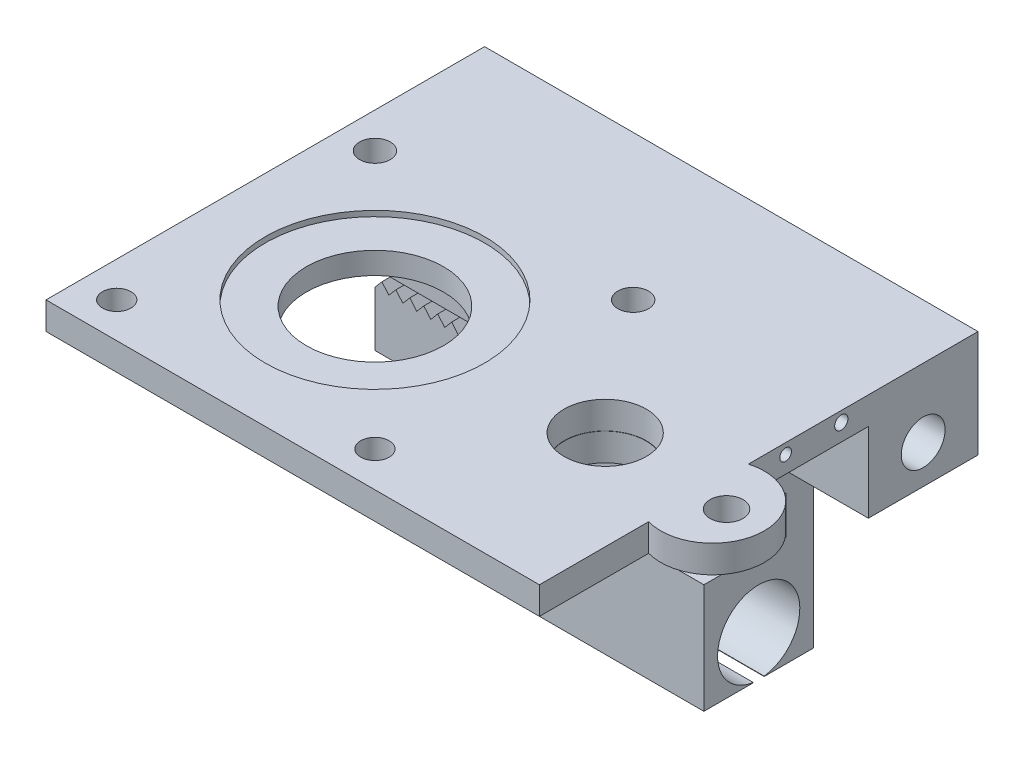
ISO-10303-21;
HEADER;
FILE_DESCRIPTION(('STEP AP214'),'2;1');
FILE_NAME('part.step','',(''),(''),'','','');
FILE_SCHEMA(('AUTOMOTIVE_DESIGN { 1 0 10303 214 1 1 1 1 }'));
ENDSEC;
DATA;
#1=APPLICATION_CONTEXT('core data for automotive mechanical design processes');
#2=APPLICATION_PROTOCOL_DEFINITION('international standard','automotive_design',2000,#1);
#3=PRODUCT_CONTEXT('',#1,'mechanical');
#4=PRODUCT('Part','Part','',(#3));
#5=PRODUCT_RELATED_PRODUCT_CATEGORY('part','',(#4));
#6=PRODUCT_DEFINITION_FORMATION('','',#4);
#7=PRODUCT_DEFINITION_CONTEXT('part definition',#1,'design');
#8=PRODUCT_DEFINITION('design','',#6,#7);
#9=PRODUCT_DEFINITION_SHAPE('','',#8);
#10=(LENGTH_UNIT() NAMED_UNIT(*) SI_UNIT(.MILLI.,.METRE.));
#11=(NAMED_UNIT(*) PLANE_ANGLE_UNIT() SI_UNIT($,.RADIAN.));
#12=(NAMED_UNIT(*) SI_UNIT($,.STERADIAN.) SOLID_ANGLE_UNIT());
#13=UNCERTAINTY_MEASURE_WITH_UNIT(LENGTH_MEASURE(1.E-05),#10,'distance_accuracy_value','');
#14=(GEOMETRIC_REPRESENTATION_CONTEXT(3) GLOBAL_UNCERTAINTY_ASSIGNED_CONTEXT((#13)) GLOBAL_UNIT_ASSIGNED_CONTEXT((#10,
#11,#12)) REPRESENTATION_CONTEXT('',''));
#15=CARTESIAN_POINT('',(0.,0.,0.));
#16=DIRECTION('',(0.,0.,1.));
#17=DIRECTION('',(1.,0.,0.));
#18=AXIS2_PLACEMENT_3D('',#15,#16,#17);
#19=CARTESIAN_POINT('',(90.,0.,0.));
#20=DIRECTION('',(-1.,0.,0.));
#21=DIRECTION('',(0.,0.,1.));
#22=AXIS2_PLACEMENT_3D('',#19,#20,#21);
#23=PLANE('',#22);
#24=DIRECTION('',(0.,0.,-1.));
#25=VECTOR('',#24,1.);
#26=CARTESIAN_POINT('',(90.,60.,20.));
#27=LINE('',#26,#25);
#28=CARTESIAN_POINT('',(90.,60.,80.));
#29=VERTEX_POINT('',#28);
#30=CARTESIAN_POINT('',(90.,60.,60.0735791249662));
#31=VERTEX_POINT('',#30);
#32=EDGE_CURVE('E338',#29,#31,#27,.T.);
#33=ORIENTED_EDGE('',*,*,#32,.T.);
#34=DIRECTION('',(0.,1.,0.));
#35=VECTOR('',#34,1.);
#36=CARTESIAN_POINT('',(90.,33.2756762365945,60.0735791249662));
#37=LINE('',#36,#35);
#38=CARTESIAN_POINT('',(90.,65.,60.0735791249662));
#39=VERTEX_POINT('',#38);
#40=EDGE_CURVE('E342',#31,#39,#37,.T.);
#41=ORIENTED_EDGE('',*,*,#40,.T.);
#42=DIRECTION('',(0.,0.,1.));
#43=VECTOR('',#42,1.);
#44=CARTESIAN_POINT('',(90.,65.,80.));
#45=LINE('',#44,#43);
#46=CARTESIAN_POINT('',(90.,65.,80.));
#47=VERTEX_POINT('',#46);
#48=EDGE_CURVE('E840',#39,#47,#45,.T.);
#49=ORIENTED_EDGE('',*,*,#48,.T.);
#50=DIRECTION('',(0.,-1.,0.));
#51=VECTOR('',#50,1.);
#52=CARTESIAN_POINT('',(90.,60.,80.));
#53=LINE('',#52,#51);
#54=EDGE_CURVE('E787',#47,#29,#53,.T.);
#55=ORIENTED_EDGE('',*,*,#54,.T.);
#56=EDGE_LOOP('',(#33,#41,#49,#55));
#57=FACE_BOUND('',#56,.T.);
#58=ADVANCED_FACE('F323',(#57),#23,.F.);
#59=CARTESIAN_POINT('',(60.,0.,20.));
#60=DIRECTION('',(-1.,0.,0.));
#61=DIRECTION('',(0.,0.,1.));
#62=AXIS2_PLACEMENT_3D('',#59,#60,#61);
#63=PLANE('',#62);
#64=DIRECTION('',(0.,-0.000631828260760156,-0.999999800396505));
#65=VECTOR('',#64,1.);
#66=CARTESIAN_POINT('',(60.,45.4873634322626,0.));
#67=LINE('',#66,#65);
#68=CARTESIAN_POINT('',(60.,45.5000000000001,20.));
#69=VERTEX_POINT('',#68);
#70=CARTESIAN_POINT('',(60.,45.4953753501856,12.6805285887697));
#71=VERTEX_POINT('',#70);
#72=EDGE_CURVE('E841',#69,#71,#67,.T.);
#73=ORIENTED_EDGE('',*,*,#72,.F.);
#74=DIRECTION('',(0.,1.,0.));
#75=VECTOR('',#74,1.);
#76=CARTESIAN_POINT('',(60.,0.,20.));
#77=LINE('',#76,#75);
#78=CARTESIAN_POINT('',(60.,40.,20.));
#79=VERTEX_POINT('',#78);
#80=EDGE_CURVE('E1381',#79,#69,#77,.T.);
#81=ORIENTED_EDGE('',*,*,#80,.F.);
#82=DIRECTION('',(0.,0.,-1.));
#83=VECTOR('',#82,1.);
#84=CARTESIAN_POINT('',(60.,40.,5.));
#85=LINE('',#84,#83);
#86=CARTESIAN_POINT('',(60.,40.,5.));
#87=VERTEX_POINT('',#86);
#88=EDGE_CURVE('E1334',#79,#87,#85,.T.);
#89=ORIENTED_EDGE('',*,*,#88,.T.);
#90=DIRECTION('',(0.,-1.,0.));
#91=VECTOR('',#90,1.);
#92=CARTESIAN_POINT('',(60.,40.,5.));
#93=LINE('',#92,#91);
#94=CARTESIAN_POINT('',(60.,37.,5.00000000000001));
#95=VERTEX_POINT('',#94);
#96=EDGE_CURVE('E1329',#87,#95,#93,.T.);
#97=ORIENTED_EDGE('',*,*,#96,.T.);
#98=DIRECTION('',(0.,0.,-1.));
#99=VECTOR('',#98,1.);
#100=CARTESIAN_POINT('',(60.,37.,5.));
#101=LINE('',#100,#99);
#102=CARTESIAN_POINT('',(60.,37.,20.));
#103=VERTEX_POINT('',#102);
#104=EDGE_CURVE('E1273',#103,#95,#101,.T.);
#105=ORIENTED_EDGE('',*,*,#104,.F.);
#106=DIRECTION('',(0.,1.,0.));
#107=VECTOR('',#106,1.);
#108=CARTESIAN_POINT('',(60.,37.,20.));
#109=LINE('',#108,#107);
#110=CARTESIAN_POINT('',(60.,27.,20.));
#111=VERTEX_POINT('',#110);
#112=EDGE_CURVE('E1270',#111,#103,#109,.T.);
#113=ORIENTED_EDGE('',*,*,#112,.F.);
#114=DIRECTION('',(0.,0.,1.));
#115=VECTOR('',#114,1.);
#116=CARTESIAN_POINT('',(60.,27.,5.));
#117=LINE('',#116,#115);
#118=CARTESIAN_POINT('',(60.,27.,5.));
#119=VERTEX_POINT('',#118);
#120=EDGE_CURVE('E1267',#119,#111,#117,.T.);
#121=ORIENTED_EDGE('',*,*,#120,.F.);
#122=CARTESIAN_POINT('',(60.,20.,5.));
#123=VERTEX_POINT('',#122);
#124=EDGE_CURVE('E1332',#119,#123,#93,.T.);
#125=ORIENTED_EDGE('',*,*,#124,.T.);
#126=DIRECTION('',(0.,0.,1.));
#127=VECTOR('',#126,1.);
#128=CARTESIAN_POINT('',(60.,20.,5.));
#129=LINE('',#128,#127);
#130=CARTESIAN_POINT('',(60.,20.,20.));
#131=VERTEX_POINT('',#130);
#132=EDGE_CURVE('E1331',#123,#131,#129,.T.);
#133=ORIENTED_EDGE('',*,*,#132,.T.);
#134=CARTESIAN_POINT('',(60.,0.,20.));
#135=VERTEX_POINT('',#134);
#136=EDGE_CURVE('E1382',#135,#131,#77,.T.);
#137=ORIENTED_EDGE('',*,*,#136,.F.);
#138=DIRECTION('',(0.,0.,-1.));
#139=VECTOR('',#138,1.);
#140=CARTESIAN_POINT('',(60.,0.,20.));
#141=LINE('',#140,#139);
#142=CARTESIAN_POINT('',(60.,0.,11.));
#143=VERTEX_POINT('',#142);
#144=EDGE_CURVE('E1394',#135,#143,#141,.T.);
#145=ORIENTED_EDGE('',*,*,#144,.T.);
#146=DIRECTION('',(0.,1.,0.));
#147=VECTOR('',#146,1.);
#148=CARTESIAN_POINT('',(60.,0.,11.));
#149=LINE('',#148,#147);
#150=CARTESIAN_POINT('',(60.,0.0669656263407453,11.));
#151=VERTEX_POINT('',#150);
#152=EDGE_CURVE('E1357',#143,#151,#149,.T.);
#153=ORIENTED_EDGE('',*,*,#152,.T.);
#154=CARTESIAN_POINT('',(60.,7.5,10.));
#155=DIRECTION('',(-1.,0.,0.));
#156=DIRECTION('',(0.,0.,-1.));
#157=AXIS2_PLACEMENT_3D('',#154,#155,#156);
#158=CIRCLE('',#157,7.5);
#159=CARTESIAN_POINT('',(60.,0.0669656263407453,9.));
#160=VERTEX_POINT('',#159);
#161=EDGE_CURVE('E1350',#151,#160,#158,.T.);
#162=ORIENTED_EDGE('',*,*,#161,.T.);
#163=DIRECTION('',(0.,-1.,0.));
#164=VECTOR('',#163,1.);
#165=CARTESIAN_POINT('',(60.,0.,9.));
#166=LINE('',#165,#164);
#167=CARTESIAN_POINT('',(60.,0.,9.));
#168=VERTEX_POINT('',#167);
#169=EDGE_CURVE('E1353',#160,#168,#166,.T.);
#170=ORIENTED_EDGE('',*,*,#169,.T.);
#171=CARTESIAN_POINT('',(60.,0.,0.));
#172=VERTEX_POINT('',#171);
#173=EDGE_CURVE('E1386',#168,#172,#141,.T.);
#174=ORIENTED_EDGE('',*,*,#173,.T.);
#175=DIRECTION('',(0.,1.,0.));
#176=VECTOR('',#175,1.);
#177=CARTESIAN_POINT('',(60.,0.,0.));
#178=LINE('',#177,#176);
#179=CARTESIAN_POINT('',(60.,45.4873634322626,0.));
#180=VERTEX_POINT('',#179);
#181=EDGE_CURVE('E1392',#172,#180,#178,.T.);
#182=ORIENTED_EDGE('',*,*,#181,.T.);
#183=CARTESIAN_POINT('',(60.,45.491993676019,7.3283249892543));
#184=VERTEX_POINT('',#183);
#185=EDGE_CURVE('E331',#184,#180,#67,.T.);
#186=ORIENTED_EDGE('',*,*,#185,.F.);
#187=CARTESIAN_POINT('',(60.,52.5,9.99999999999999));
#188=DIRECTION('',(-1.,0.,0.));
#189=DIRECTION('',(0.,0.,1.));
#190=AXIS2_PLACEMENT_3D('',#187,#188,#189);
#191=CIRCLE('',#190,7.5);
#192=EDGE_CURVE('E1302',#184,#71,#191,.T.);
#193=ORIENTED_EDGE('',*,*,#192,.T.);
#194=EDGE_LOOP('',(#73,#81,#89,#97,#105,#113,#121,#125,#133,#137,#145,#153,#162,#170,#174,#182,
#186,#193));
#195=FACE_BOUND('',#194,.T.);
#196=ADVANCED_FACE('F1441',(#195),#63,.F.);
#197=CARTESIAN_POINT('',(60.,40.,5.));
#198=DIRECTION('',(0.,0.,-1.));
#199=DIRECTION('',(0.,1.,0.));
#200=AXIS2_PLACEMENT_3D('',#197,#198,#199);
#201=PLANE('',#200);
#202=DIRECTION('',(0.646977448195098,0.76250913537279,0.));
#203=VECTOR('',#202,1.);
#204=CARTESIAN_POINT('',(25.4671649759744,29.3005872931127,5.00000000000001));
#205=LINE('',#204,#203);
#206=CARTESIAN_POINT('',(32.,37.,5.00000000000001));
#207=VERTEX_POINT('',#206);
#208=CARTESIAN_POINT('',(33.2727272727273,38.5,5.00000000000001));
#209=VERTEX_POINT('',#208);
#210=EDGE_CURVE('E890',#207,#209,#205,.T.);
#211=ORIENTED_EDGE('',*,*,#210,.T.);
#212=DIRECTION('',(0.646977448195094,-0.762509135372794,0.));
#213=VECTOR('',#212,1.);
#214=CARTESIAN_POINT('',(63.4532835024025,2.93005872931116,5.00000000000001));
#215=LINE('',#214,#213);
#216=CARTESIAN_POINT('',(34.5454545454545,37.,5.00000000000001));
#217=VERTEX_POINT('',#216);
#218=EDGE_CURVE('E895',#209,#217,#215,.T.);
#219=ORIENTED_EDGE('',*,*,#218,.T.);
#220=DIRECTION('',(0.646977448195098,0.76250913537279,0.));
#221=VECTOR('',#220,1.);
#222=CARTESIAN_POINT('',(26.9471436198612,28.0448478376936,5.00000000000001));
#223=LINE('',#222,#221);
#224=CARTESIAN_POINT('',(35.8181818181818,38.5,5.00000000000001));
#225=VERTEX_POINT('',#224);
#226=EDGE_CURVE('E904',#217,#225,#223,.T.);
#227=ORIENTED_EDGE('',*,*,#226,.T.);
#228=DIRECTION('',(0.646977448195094,-0.762509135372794,0.));
#229=VECTOR('',#228,1.);
#230=CARTESIAN_POINT('',(64.9332621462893,4.18579818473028,5.00000000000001));
#231=LINE('',#230,#229);
#232=CARTESIAN_POINT('',(37.0909090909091,37.,5.00000000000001));
#233=VERTEX_POINT('',#232);
#234=EDGE_CURVE('E913',#225,#233,#231,.T.);
#235=ORIENTED_EDGE('',*,*,#234,.T.);
#236=DIRECTION('',(0.646977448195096,0.762509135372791,0.));
#237=VECTOR('',#236,1.);
#238=CARTESIAN_POINT('',(28.427122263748,26.7891083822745,5.00000000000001));
#239=LINE('',#238,#237);
#240=CARTESIAN_POINT('',(38.3636363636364,38.5,5.00000000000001));
#241=VERTEX_POINT('',#240);
#242=EDGE_CURVE('E920',#233,#241,#239,.T.);
#243=ORIENTED_EDGE('',*,*,#242,.T.);
#244=DIRECTION('',(0.646977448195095,-0.762509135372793,0.));
#245=VECTOR('',#244,1.);
#246=CARTESIAN_POINT('',(66.4132407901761,5.44153764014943,5.00000000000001));
#247=LINE('',#246,#245);
#248=CARTESIAN_POINT('',(39.6363636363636,37.,5.00000000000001));
#249=VERTEX_POINT('',#248);
#250=EDGE_CURVE('E929',#241,#249,#247,.T.);
#251=ORIENTED_EDGE('',*,*,#250,.T.);
#252=DIRECTION('',(0.646977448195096,0.762509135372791,0.));
#253=VECTOR('',#252,1.);
#254=CARTESIAN_POINT('',(29.9071009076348,25.5333689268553,5.00000000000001));
#255=LINE('',#254,#253);
#256=CARTESIAN_POINT('',(40.9090909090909,38.5,5.00000000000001));
#257=VERTEX_POINT('',#256);
#258=EDGE_CURVE('E940',#249,#257,#255,.T.);
#259=ORIENTED_EDGE('',*,*,#258,.T.);
#260=DIRECTION('',(0.646977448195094,-0.762509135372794,0.));
#261=VECTOR('',#260,1.);
#262=CARTESIAN_POINT('',(67.8932194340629,6.6972770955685,5.00000000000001));
#263=LINE('',#262,#261);
#264=CARTESIAN_POINT('',(42.1818181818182,37.,5.00000000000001));
#265=VERTEX_POINT('',#264);
#266=EDGE_CURVE('E944',#257,#265,#263,.T.);
#267=ORIENTED_EDGE('',*,*,#266,.T.);
#268=DIRECTION('',(0.646977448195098,0.76250913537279,0.));
#269=VECTOR('',#268,1.);
#270=CARTESIAN_POINT('',(31.3870795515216,24.2776294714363,5.00000000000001));
#271=LINE('',#270,#269);
#272=CARTESIAN_POINT('',(43.4545454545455,38.5,5.00000000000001));
#273=VERTEX_POINT('',#272);
#274=EDGE_CURVE('E953',#265,#273,#271,.T.);
#275=ORIENTED_EDGE('',*,*,#274,.T.);
#276=DIRECTION('',(0.646977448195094,-0.762509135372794,0.));
#277=VECTOR('',#276,1.);
#278=CARTESIAN_POINT('',(69.3731980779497,7.95301655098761,5.00000000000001));
#279=LINE('',#278,#277);
#280=CARTESIAN_POINT('',(44.7272727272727,37.,5.00000000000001));
#281=VERTEX_POINT('',#280);
#282=EDGE_CURVE('E962',#273,#281,#279,.T.);
#283=ORIENTED_EDGE('',*,*,#282,.T.);
#284=DIRECTION('',(0.646977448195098,0.76250913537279,0.));
#285=VECTOR('',#284,1.);
#286=CARTESIAN_POINT('',(32.8670581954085,23.0218900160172,5.00000000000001));
#287=LINE('',#286,#285);
#288=CARTESIAN_POINT('',(46.,38.5,5.00000000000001));
#289=VERTEX_POINT('',#288);
#290=EDGE_CURVE('E969',#281,#289,#287,.T.);
#291=ORIENTED_EDGE('',*,*,#290,.T.);
#292=DIRECTION('',(0.646977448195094,-0.762509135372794,0.));
#293=VECTOR('',#292,1.);
#294=CARTESIAN_POINT('',(70.8531767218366,9.20875600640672,5.00000000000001));
#295=LINE('',#294,#293);
#296=CARTESIAN_POINT('',(47.2727272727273,37.,5.00000000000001));
#297=VERTEX_POINT('',#296);
#298=EDGE_CURVE('E978',#289,#297,#295,.T.);
#299=ORIENTED_EDGE('',*,*,#298,.T.);
#300=DIRECTION('',(0.646977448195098,0.76250913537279,0.));
#301=VECTOR('',#300,1.);
#302=CARTESIAN_POINT('',(34.3470368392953,21.7661505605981,5.00000000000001));
#303=LINE('',#302,#301);
#304=CARTESIAN_POINT('',(48.5454545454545,38.5,5.00000000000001));
#305=VERTEX_POINT('',#304);
#306=EDGE_CURVE('E985',#297,#305,#303,.T.);
#307=ORIENTED_EDGE('',*,*,#306,.T.);
#308=DIRECTION('',(0.646977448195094,-0.762509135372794,0.));
#309=VECTOR('',#308,1.);
#310=CARTESIAN_POINT('',(72.3331553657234,10.4644954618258,5.00000000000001));
#311=LINE('',#310,#309);
#312=CARTESIAN_POINT('',(49.8181818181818,37.,5.00000000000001));
#313=VERTEX_POINT('',#312);
#314=EDGE_CURVE('E994',#305,#313,#311,.T.);
#315=ORIENTED_EDGE('',*,*,#314,.T.);
#316=DIRECTION('',(0.646977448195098,0.76250913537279,0.));
#317=VECTOR('',#316,1.);
#318=CARTESIAN_POINT('',(35.8270154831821,20.5104111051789,5.00000000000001));
#319=LINE('',#318,#317);
#320=CARTESIAN_POINT('',(51.0909090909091,38.5,5.00000000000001));
#321=VERTEX_POINT('',#320);
#322=EDGE_CURVE('E1001',#313,#321,#319,.T.);
#323=ORIENTED_EDGE('',*,*,#322,.T.);
#324=DIRECTION('',(0.646977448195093,-0.762509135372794,0.));
#325=VECTOR('',#324,1.);
#326=CARTESIAN_POINT('',(73.8131340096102,11.7202349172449,5.00000000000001));
#327=LINE('',#326,#325);
#328=CARTESIAN_POINT('',(52.3636363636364,37.,5.00000000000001));
#329=VERTEX_POINT('',#328);
#330=EDGE_CURVE('E1010',#321,#329,#327,.T.);
#331=ORIENTED_EDGE('',*,*,#330,.T.);
#332=DIRECTION('',(0.646977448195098,0.76250913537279,0.));
#333=VECTOR('',#332,1.);
#334=CARTESIAN_POINT('',(37.3069941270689,19.2546716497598,5.00000000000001));
#335=LINE('',#334,#333);
#336=CARTESIAN_POINT('',(53.6363636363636,38.5,5.00000000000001));
#337=VERTEX_POINT('',#336);
#338=EDGE_CURVE('E1021',#329,#337,#335,.T.);
#339=ORIENTED_EDGE('',*,*,#338,.T.);
#340=DIRECTION('',(0.646977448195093,-0.762509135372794,0.));
#341=VECTOR('',#340,1.);
#342=CARTESIAN_POINT('',(75.293112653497,12.975974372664,5.00000000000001));
#343=LINE('',#342,#341);
#344=CARTESIAN_POINT('',(54.9090909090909,37.,5.00000000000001));
#345=VERTEX_POINT('',#344);
#346=EDGE_CURVE('E1025',#337,#345,#343,.T.);
#347=ORIENTED_EDGE('',*,*,#346,.T.);
#348=DIRECTION('',(0.646977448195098,0.76250913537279,0.));
#349=VECTOR('',#348,1.);
#350=CARTESIAN_POINT('',(38.7869727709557,17.9989321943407,5.00000000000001));
#351=LINE('',#350,#349);
#352=CARTESIAN_POINT('',(56.1818181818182,38.5,5.00000000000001));
#353=VERTEX_POINT('',#352);
#354=EDGE_CURVE('E1038',#345,#353,#351,.T.);
#355=ORIENTED_EDGE('',*,*,#354,.T.);
#356=DIRECTION('',(0.646977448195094,-0.762509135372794,0.));
#357=VECTOR('',#356,1.);
#358=CARTESIAN_POINT('',(76.7730912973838,14.2317138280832,5.00000000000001));
#359=LINE('',#358,#357);
#360=CARTESIAN_POINT('',(57.4545454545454,37.,5.00000000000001));
#361=VERTEX_POINT('',#360);
#362=EDGE_CURVE('E1042',#353,#361,#359,.T.);
#363=ORIENTED_EDGE('',*,*,#362,.T.);
#364=DIRECTION('',(0.646977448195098,0.76250913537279,0.));
#365=VECTOR('',#364,1.);
#366=CARTESIAN_POINT('',(40.2669514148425,16.7431927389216,5.00000000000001));
#367=LINE('',#366,#365);
#368=CARTESIAN_POINT('',(58.7272727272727,38.5,5.));
#369=VERTEX_POINT('',#368);
#370=EDGE_CURVE('E1051',#361,#369,#367,.T.);
#371=ORIENTED_EDGE('',*,*,#370,.T.);
#372=DIRECTION('',(-0.646977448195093,0.762509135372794,0.));
#373=VECTOR('',#372,1.);
#374=CARTESIAN_POINT('',(78.2530699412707,15.4874532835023,5.00000000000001));
#375=LINE('',#374,#373);
#376=EDGE_CURVE('E1048',#95,#369,#375,.T.);
#377=ORIENTED_EDGE('',*,*,#376,.F.);
#378=ORIENTED_EDGE('',*,*,#96,.F.);
#379=DIRECTION('',(-1.,0.,0.));
#380=VECTOR('',#379,1.);
#381=CARTESIAN_POINT('',(60.,40.,5.));
#382=LINE('',#381,#380);
#383=CARTESIAN_POINT('',(0.,40.,5.));
#384=VERTEX_POINT('',#383);
#385=EDGE_CURVE('E1314',#87,#384,#382,.T.);
#386=ORIENTED_EDGE('',*,*,#385,.T.);
#387=DIRECTION('',(0.,-1.,0.));
#388=VECTOR('',#387,1.);
#389=CARTESIAN_POINT('',(0.,40.,5.));
#390=LINE('',#389,#388);
#391=CARTESIAN_POINT('',(0.,37.,5.00000000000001));
#392=VERTEX_POINT('',#391);
#393=EDGE_CURVE('E1338',#384,#392,#390,.T.);
#394=ORIENTED_EDGE('',*,*,#393,.T.);
#395=DIRECTION('',(0.646977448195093,0.762509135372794,0.));
#396=VECTOR('',#395,1.);
#397=CARTESIAN_POINT('',(-18.2530699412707,15.4874532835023,5.00000000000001));
#398=LINE('',#397,#396);
#399=CARTESIAN_POINT('',(1.27272727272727,38.5,5.00000000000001));
#400=VERTEX_POINT('',#399);
#401=EDGE_CURVE('E1231',#392,#400,#398,.T.);
#402=ORIENTED_EDGE('',*,*,#401,.T.);
#403=DIRECTION('',(-0.646977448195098,0.76250913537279,0.));
#404=VECTOR('',#403,1.);
#405=CARTESIAN_POINT('',(19.7330485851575,16.7431927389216,5.00000000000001));
#406=LINE('',#405,#404);
#407=CARTESIAN_POINT('',(2.54545454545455,37.,5.00000000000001));
#408=VERTEX_POINT('',#407);
#409=EDGE_CURVE('E1234',#408,#400,#406,.T.);
#410=ORIENTED_EDGE('',*,*,#409,.F.);
#411=DIRECTION('',(-0.646977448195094,-0.762509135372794,0.));
#412=VECTOR('',#411,1.);
#413=CARTESIAN_POINT('',(-16.7730912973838,14.2317138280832,5.00000000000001));
#414=LINE('',#413,#412);
#415=CARTESIAN_POINT('',(3.81818181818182,38.5,5.));
#416=VERTEX_POINT('',#415);
#417=EDGE_CURVE('E1219',#416,#408,#414,.T.);
#418=ORIENTED_EDGE('',*,*,#417,.F.);
#419=DIRECTION('',(-0.646977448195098,0.76250913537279,0.));
#420=VECTOR('',#419,1.);
#421=CARTESIAN_POINT('',(21.2130272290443,17.9989321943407,5.00000000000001));
#422=LINE('',#421,#420);
#423=CARTESIAN_POINT('',(5.0909090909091,37.,5.));
#424=VERTEX_POINT('',#423);
#425=EDGE_CURVE('E1206',#424,#416,#422,.T.);
#426=ORIENTED_EDGE('',*,*,#425,.F.);
#427=DIRECTION('',(-0.646977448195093,-0.762509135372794,0.));
#428=VECTOR('',#427,1.);
#429=CARTESIAN_POINT('',(-15.293112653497,12.975974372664,5.00000000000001));
#430=LINE('',#429,#428);
#431=CARTESIAN_POINT('',(6.36363636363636,38.5,5.));
#432=VERTEX_POINT('',#431);
#433=EDGE_CURVE('E1202',#432,#424,#430,.T.);
#434=ORIENTED_EDGE('',*,*,#433,.F.);
#435=DIRECTION('',(-0.646977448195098,0.76250913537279,0.));
#436=VECTOR('',#435,1.);
#437=CARTESIAN_POINT('',(22.6930058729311,19.2546716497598,5.00000000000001));
#438=LINE('',#437,#436);
#439=CARTESIAN_POINT('',(7.63636363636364,37.,5.));
#440=VERTEX_POINT('',#439);
#441=EDGE_CURVE('E1190',#440,#432,#438,.T.);
#442=ORIENTED_EDGE('',*,*,#441,.F.);
#443=DIRECTION('',(-0.646977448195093,-0.762509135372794,0.));
#444=VECTOR('',#443,1.);
#445=CARTESIAN_POINT('',(-13.8131340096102,11.7202349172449,5.00000000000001));
#446=LINE('',#445,#444);
#447=CARTESIAN_POINT('',(8.90909090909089,38.5,5.));
#448=VERTEX_POINT('',#447);
#449=EDGE_CURVE('E1182',#448,#440,#446,.T.);
#450=ORIENTED_EDGE('',*,*,#449,.F.);
#451=DIRECTION('',(-0.646977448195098,0.76250913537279,0.));
#452=VECTOR('',#451,1.);
#453=CARTESIAN_POINT('',(24.1729845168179,20.5104111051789,5.00000000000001));
#454=LINE('',#453,#452);
#455=CARTESIAN_POINT('',(10.1818181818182,37.,5.));
#456=VERTEX_POINT('',#455);
#457=EDGE_CURVE('E1186',#456,#448,#454,.T.);
#458=ORIENTED_EDGE('',*,*,#457,.F.);
#459=DIRECTION('',(-0.646977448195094,-0.762509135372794,0.));
#460=VECTOR('',#459,1.);
#461=CARTESIAN_POINT('',(-12.3331553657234,10.4644954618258,5.00000000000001));
#462=LINE('',#461,#460);
#463=CARTESIAN_POINT('',(11.4545454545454,38.5,5.));
#464=VERTEX_POINT('',#463);
#465=EDGE_CURVE('E1165',#464,#456,#462,.T.);
#466=ORIENTED_EDGE('',*,*,#465,.F.);
#467=DIRECTION('',(-0.646977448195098,0.76250913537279,0.));
#468=VECTOR('',#467,1.);
#469=CARTESIAN_POINT('',(25.6529631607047,21.7661505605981,5.00000000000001));
#470=LINE('',#469,#468);
#471=CARTESIAN_POINT('',(12.7272727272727,37.,5.));
#472=VERTEX_POINT('',#471);
#473=EDGE_CURVE('E1169',#472,#464,#470,.T.);
#474=ORIENTED_EDGE('',*,*,#473,.F.);
#475=DIRECTION('',(-0.646977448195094,-0.762509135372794,0.));
#476=VECTOR('',#475,1.);
#477=CARTESIAN_POINT('',(-10.8531767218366,9.20875600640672,5.00000000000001));
#478=LINE('',#477,#476);
#479=CARTESIAN_POINT('',(14.,38.5,5.));
#480=VERTEX_POINT('',#479);
#481=EDGE_CURVE('E1148',#480,#472,#478,.T.);
#482=ORIENTED_EDGE('',*,*,#481,.F.);
#483=DIRECTION('',(-0.646977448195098,0.76250913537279,0.));
#484=VECTOR('',#483,1.);
#485=CARTESIAN_POINT('',(27.1329418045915,23.0218900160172,5.00000000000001));
#486=LINE('',#485,#484);
#487=CARTESIAN_POINT('',(15.2727272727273,37.,5.));
#488=VERTEX_POINT('',#487);
#489=EDGE_CURVE('E1152',#488,#480,#486,.T.);
#490=ORIENTED_EDGE('',*,*,#489,.F.);
#491=DIRECTION('',(-0.646977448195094,-0.762509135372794,0.));
#492=VECTOR('',#491,1.);
#493=CARTESIAN_POINT('',(-9.37319807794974,7.95301655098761,5.00000000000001));
#494=LINE('',#493,#492);
#495=CARTESIAN_POINT('',(16.5454545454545,38.5,5.));
#496=VERTEX_POINT('',#495);
#497=EDGE_CURVE('E1131',#496,#488,#494,.T.);
#498=ORIENTED_EDGE('',*,*,#497,.F.);
#499=DIRECTION('',(-0.646977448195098,0.76250913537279,0.));
#500=VECTOR('',#499,1.);
#501=CARTESIAN_POINT('',(28.6129204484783,24.2776294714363,5.00000000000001));
#502=LINE('',#501,#500);
#503=CARTESIAN_POINT('',(17.8181818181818,37.,5.));
#504=VERTEX_POINT('',#503);
#505=EDGE_CURVE('E1135',#504,#496,#502,.T.);
#506=ORIENTED_EDGE('',*,*,#505,.F.);
#507=DIRECTION('',(-0.646977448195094,-0.762509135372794,0.));
#508=VECTOR('',#507,1.);
#509=CARTESIAN_POINT('',(-7.89321943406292,6.6972770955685,5.00000000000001));
#510=LINE('',#509,#508);
#511=CARTESIAN_POINT('',(19.0909090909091,38.5,5.));
#512=VERTEX_POINT('',#511);
#513=EDGE_CURVE('E1117',#512,#504,#510,.T.);
#514=ORIENTED_EDGE('',*,*,#513,.F.);
#515=DIRECTION('',(-0.646977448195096,0.762509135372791,0.));
#516=VECTOR('',#515,1.);
#517=CARTESIAN_POINT('',(30.0928990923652,25.5333689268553,5.00000000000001));
#518=LINE('',#517,#516);
#519=CARTESIAN_POINT('',(20.3636363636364,37.,5.));
#520=VERTEX_POINT('',#519);
#521=EDGE_CURVE('E1105',#520,#512,#518,.T.);
#522=ORIENTED_EDGE('',*,*,#521,.F.);
#523=DIRECTION('',(-0.646977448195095,-0.762509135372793,0.));
#524=VECTOR('',#523,1.);
#525=CARTESIAN_POINT('',(-6.41324079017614,5.44153764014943,5.00000000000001));
#526=LINE('',#525,#524);
#527=CARTESIAN_POINT('',(21.6363636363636,38.5,5.));
#528=VERTEX_POINT('',#527);
#529=EDGE_CURVE('E1097',#528,#520,#526,.T.);
#530=ORIENTED_EDGE('',*,*,#529,.F.);
#531=DIRECTION('',(-0.646977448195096,0.762509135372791,0.));
#532=VECTOR('',#531,1.);
#533=CARTESIAN_POINT('',(31.572877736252,26.7891083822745,5.00000000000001));
#534=LINE('',#533,#532);
#535=CARTESIAN_POINT('',(22.9090909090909,37.,5.));
#536=VERTEX_POINT('',#535);
#537=EDGE_CURVE('E1101',#536,#528,#534,.T.);
#538=ORIENTED_EDGE('',*,*,#537,.F.);
#539=DIRECTION('',(-0.646977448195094,-0.762509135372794,0.));
#540=VECTOR('',#539,1.);
#541=CARTESIAN_POINT('',(-4.93326214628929,4.18579818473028,5.00000000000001));
#542=LINE('',#541,#540);
#543=CARTESIAN_POINT('',(24.1818181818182,38.5,5.));
#544=VERTEX_POINT('',#543);
#545=EDGE_CURVE('E1080',#544,#536,#542,.T.);
#546=ORIENTED_EDGE('',*,*,#545,.F.);
#547=DIRECTION('',(-0.646977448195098,0.76250913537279,0.));
#548=VECTOR('',#547,1.);
#549=CARTESIAN_POINT('',(33.0528563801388,28.0448478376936,5.00000000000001));
#550=LINE('',#549,#548);
#551=CARTESIAN_POINT('',(25.4545454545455,37.,5.));
#552=VERTEX_POINT('',#551);
#553=EDGE_CURVE('E1084',#552,#544,#550,.T.);
#554=ORIENTED_EDGE('',*,*,#553,.F.);
#555=DIRECTION('',(-0.646977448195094,-0.762509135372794,0.));
#556=VECTOR('',#555,1.);
#557=CARTESIAN_POINT('',(-3.45328350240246,2.93005872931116,5.00000000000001));
#558=LINE('',#557,#556);
#559=CARTESIAN_POINT('',(26.7272727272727,38.5,5.));
#560=VERTEX_POINT('',#559);
#561=EDGE_CURVE('E1066',#560,#552,#558,.T.);
#562=ORIENTED_EDGE('',*,*,#561,.F.);
#563=DIRECTION('',(-0.646977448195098,0.76250913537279,0.));
#564=VECTOR('',#563,1.);
#565=CARTESIAN_POINT('',(34.5328350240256,29.3005872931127,5.00000000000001));
#566=LINE('',#565,#564);
#567=CARTESIAN_POINT('',(28.,37.,5.));
#568=VERTEX_POINT('',#567);
#569=EDGE_CURVE('E1062',#568,#560,#566,.T.);
#570=ORIENTED_EDGE('',*,*,#569,.F.);
#571=DIRECTION('',(0.,-1.,0.));
#572=VECTOR('',#571,1.);
#573=CARTESIAN_POINT('',(28.,37.,5.));
#574=LINE('',#573,#572);
#575=CARTESIAN_POINT('',(28.,27.,5.));
#576=VERTEX_POINT('',#575);
#577=EDGE_CURVE('E1253',#568,#576,#574,.T.);
#578=ORIENTED_EDGE('',*,*,#577,.T.);
#579=DIRECTION('',(-1.,0.,0.));
#580=VECTOR('',#579,1.);
#581=CARTESIAN_POINT('',(60.,27.,5.));
#582=LINE('',#581,#580);
#583=CARTESIAN_POINT('',(0.,27.,5.));
#584=VERTEX_POINT('',#583);
#585=EDGE_CURVE('E1276',#576,#584,#582,.T.);
#586=ORIENTED_EDGE('',*,*,#585,.T.);
#587=CARTESIAN_POINT('',(0.,20.,5.));
#588=VERTEX_POINT('',#587);
#589=EDGE_CURVE('E1342',#584,#588,#390,.T.);
#590=ORIENTED_EDGE('',*,*,#589,.T.);
#591=DIRECTION('',(-1.,0.,0.));
#592=VECTOR('',#591,1.);
#593=CARTESIAN_POINT('',(60.,20.,5.));
#594=LINE('',#593,#592);
#595=EDGE_CURVE('E1337',#123,#588,#594,.T.);
#596=ORIENTED_EDGE('',*,*,#595,.F.);
#597=ORIENTED_EDGE('',*,*,#124,.F.);
#598=CARTESIAN_POINT('',(32.,27.,5.));
#599=VERTEX_POINT('',#598);
#600=EDGE_CURVE('E1289',#119,#599,#582,.T.);
#601=ORIENTED_EDGE('',*,*,#600,.T.);
#602=DIRECTION('',(0.,1.,0.));
#603=VECTOR('',#602,1.);
#604=CARTESIAN_POINT('',(32.,37.,5.));
#605=LINE('',#604,#603);
#606=EDGE_CURVE('E1257',#599,#207,#605,.T.);
#607=ORIENTED_EDGE('',*,*,#606,.T.);
#608=EDGE_LOOP('',(#211,#219,#227,#235,#243,#251,#259,#267,#275,#283,#291,#299,#307,#315,#323,
#331,#339,#347,#355,#363,#371,#377,#378,#386,#394,#402,#410,#418,#426,#434,#442,#450,#458,#466,
#474,#482,#490,#498,#506,#514,#522,#530,#538,#546,#554,#562,#570,#578,#586,#590,#596,#597,#601,#607));
#609=FACE_BOUND('',#608,.T.);
#610=ADVANCED_FACE('F1446',(#609),#201,.F.);
#611=CARTESIAN_POINT('',(60.,37.,20.));
#612=DIRECTION('',(0.,0.,1.));
#613=DIRECTION('',(0.,-1.,0.));
#614=AXIS2_PLACEMENT_3D('',#611,#612,#613);
#615=PLANE('',#614);
#616=DIRECTION('',(0.,1.,0.));
#617=VECTOR('',#616,1.);
#618=CARTESIAN_POINT('',(32.,37.,20.));
#619=LINE('',#618,#617);
#620=CARTESIAN_POINT('',(32.,27.,20.));
#621=VERTEX_POINT('',#620);
#622=CARTESIAN_POINT('',(32.,37.,20.));
#623=VERTEX_POINT('',#622);
#624=EDGE_CURVE('E1248',#621,#623,#619,.T.);
#625=ORIENTED_EDGE('',*,*,#624,.F.);
#626=DIRECTION('',(-1.,0.,0.));
#627=VECTOR('',#626,1.);
#628=CARTESIAN_POINT('',(60.,27.,20.));
#629=LINE('',#628,#627);
#630=EDGE_CURVE('E1284',#111,#621,#629,.T.);
#631=ORIENTED_EDGE('',*,*,#630,.F.);
#632=ORIENTED_EDGE('',*,*,#112,.T.);
#633=DIRECTION('',(-0.646977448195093,0.762509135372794,0.));
#634=VECTOR('',#633,1.);
#635=CARTESIAN_POINT('',(78.2530699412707,15.4874532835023,20.));
#636=LINE('',#635,#634);
#637=CARTESIAN_POINT('',(58.7272727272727,38.5,20.));
#638=VERTEX_POINT('',#637);
#639=EDGE_CURVE('E1045',#103,#638,#636,.T.);
#640=ORIENTED_EDGE('',*,*,#639,.T.);
#641=DIRECTION('',(0.646977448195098,0.76250913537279,0.));
#642=VECTOR('',#641,1.);
#643=CARTESIAN_POINT('',(40.2669514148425,16.7431927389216,20.));
#644=LINE('',#643,#642);
#645=CARTESIAN_POINT('',(57.4545454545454,37.,20.));
#646=VERTEX_POINT('',#645);
#647=EDGE_CURVE('E1052',#646,#638,#644,.T.);
#648=ORIENTED_EDGE('',*,*,#647,.F.);
#649=DIRECTION('',(0.646977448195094,-0.762509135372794,0.));
#650=VECTOR('',#649,1.);
#651=CARTESIAN_POINT('',(76.7730912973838,14.2317138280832,20.));
#652=LINE('',#651,#650);
#653=CARTESIAN_POINT('',(56.1818181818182,38.5,20.));
#654=VERTEX_POINT('',#653);
#655=EDGE_CURVE('E1034',#654,#646,#652,.T.);
#656=ORIENTED_EDGE('',*,*,#655,.F.);
#657=DIRECTION('',(0.646977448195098,0.76250913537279,0.));
#658=VECTOR('',#657,1.);
#659=CARTESIAN_POINT('',(38.7869727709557,17.9989321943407,20.));
#660=LINE('',#659,#658);
#661=CARTESIAN_POINT('',(54.9090909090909,37.,20.));
#662=VERTEX_POINT('',#661);
#663=EDGE_CURVE('E1028',#662,#654,#660,.T.);
#664=ORIENTED_EDGE('',*,*,#663,.F.);
#665=DIRECTION('',(0.646977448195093,-0.762509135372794,0.));
#666=VECTOR('',#665,1.);
#667=CARTESIAN_POINT('',(75.293112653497,12.975974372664,20.));
#668=LINE('',#667,#666);
#669=CARTESIAN_POINT('',(53.6363636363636,38.5,20.));
#670=VERTEX_POINT('',#669);
#671=EDGE_CURVE('E1017',#670,#662,#668,.T.);
#672=ORIENTED_EDGE('',*,*,#671,.F.);
#673=DIRECTION('',(0.646977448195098,0.76250913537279,0.));
#674=VECTOR('',#673,1.);
#675=CARTESIAN_POINT('',(37.3069941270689,19.2546716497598,20.));
#676=LINE('',#675,#674);
#677=CARTESIAN_POINT('',(52.3636363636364,37.,20.));
#678=VERTEX_POINT('',#677);
#679=EDGE_CURVE('E1013',#678,#670,#676,.T.);
#680=ORIENTED_EDGE('',*,*,#679,.F.);
#681=DIRECTION('',(0.646977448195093,-0.762509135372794,0.));
#682=VECTOR('',#681,1.);
#683=CARTESIAN_POINT('',(73.8131340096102,11.7202349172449,20.));
#684=LINE('',#683,#682);
#685=CARTESIAN_POINT('',(51.0909090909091,38.5,20.));
#686=VERTEX_POINT('',#685);
#687=EDGE_CURVE('E1002',#686,#678,#684,.T.);
#688=ORIENTED_EDGE('',*,*,#687,.F.);
#689=DIRECTION('',(0.646977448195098,0.76250913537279,0.));
#690=VECTOR('',#689,1.);
#691=CARTESIAN_POINT('',(35.8270154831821,20.5104111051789,20.));
#692=LINE('',#691,#690);
#693=CARTESIAN_POINT('',(49.8181818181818,37.,20.));
#694=VERTEX_POINT('',#693);
#695=EDGE_CURVE('E997',#694,#686,#692,.T.);
#696=ORIENTED_EDGE('',*,*,#695,.F.);
#697=DIRECTION('',(0.646977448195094,-0.762509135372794,0.));
#698=VECTOR('',#697,1.);
#699=CARTESIAN_POINT('',(72.3331553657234,10.4644954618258,20.));
#700=LINE('',#699,#698);
#701=CARTESIAN_POINT('',(48.5454545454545,38.5,20.));
#702=VERTEX_POINT('',#701);
#703=EDGE_CURVE('E986',#702,#694,#700,.T.);
#704=ORIENTED_EDGE('',*,*,#703,.F.);
#705=DIRECTION('',(0.646977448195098,0.76250913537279,0.));
#706=VECTOR('',#705,1.);
#707=CARTESIAN_POINT('',(34.3470368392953,21.7661505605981,20.));
#708=LINE('',#707,#706);
#709=CARTESIAN_POINT('',(47.2727272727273,37.,20.));
#710=VERTEX_POINT('',#709);
#711=EDGE_CURVE('E981',#710,#702,#708,.T.);
#712=ORIENTED_EDGE('',*,*,#711,.F.);
#713=DIRECTION('',(0.646977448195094,-0.762509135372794,0.));
#714=VECTOR('',#713,1.);
#715=CARTESIAN_POINT('',(70.8531767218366,9.20875600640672,20.));
#716=LINE('',#715,#714);
#717=CARTESIAN_POINT('',(46.,38.5,20.));
#718=VERTEX_POINT('',#717);
#719=EDGE_CURVE('E970',#718,#710,#716,.T.);
#720=ORIENTED_EDGE('',*,*,#719,.F.);
#721=DIRECTION('',(0.646977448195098,0.76250913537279,0.));
#722=VECTOR('',#721,1.);
#723=CARTESIAN_POINT('',(32.8670581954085,23.0218900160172,20.));
#724=LINE('',#723,#722);
#725=CARTESIAN_POINT('',(44.7272727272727,37.,20.));
#726=VERTEX_POINT('',#725);
#727=EDGE_CURVE('E965',#726,#718,#724,.T.);
#728=ORIENTED_EDGE('',*,*,#727,.F.);
#729=DIRECTION('',(0.646977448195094,-0.762509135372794,0.));
#730=VECTOR('',#729,1.);
#731=CARTESIAN_POINT('',(69.3731980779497,7.95301655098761,20.));
#732=LINE('',#731,#730);
#733=CARTESIAN_POINT('',(43.4545454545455,38.5,20.));
#734=VERTEX_POINT('',#733);
#735=EDGE_CURVE('E954',#734,#726,#732,.T.);
#736=ORIENTED_EDGE('',*,*,#735,.F.);
#737=DIRECTION('',(0.646977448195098,0.76250913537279,0.));
#738=VECTOR('',#737,1.);
#739=CARTESIAN_POINT('',(31.3870795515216,24.2776294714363,20.));
#740=LINE('',#739,#738);
#741=CARTESIAN_POINT('',(42.1818181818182,37.,20.));
#742=VERTEX_POINT('',#741);
#743=EDGE_CURVE('E947',#742,#734,#740,.T.);
#744=ORIENTED_EDGE('',*,*,#743,.F.);
#745=DIRECTION('',(0.646977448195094,-0.762509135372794,0.));
#746=VECTOR('',#745,1.);
#747=CARTESIAN_POINT('',(67.8932194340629,6.6972770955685,20.));
#748=LINE('',#747,#746);
#749=CARTESIAN_POINT('',(40.9090909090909,38.5,20.));
#750=VERTEX_POINT('',#749);
#751=EDGE_CURVE('E936',#750,#742,#748,.T.);
#752=ORIENTED_EDGE('',*,*,#751,.F.);
#753=DIRECTION('',(0.646977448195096,0.762509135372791,0.));
#754=VECTOR('',#753,1.);
#755=CARTESIAN_POINT('',(29.9071009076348,25.5333689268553,20.));
#756=LINE('',#755,#754);
#757=CARTESIAN_POINT('',(39.6363636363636,37.,20.));
#758=VERTEX_POINT('',#757);
#759=EDGE_CURVE('E932',#758,#750,#756,.T.);
#760=ORIENTED_EDGE('',*,*,#759,.F.);
#761=DIRECTION('',(0.646977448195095,-0.762509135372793,0.));
#762=VECTOR('',#761,1.);
#763=CARTESIAN_POINT('',(66.4132407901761,5.44153764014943,20.));
#764=LINE('',#763,#762);
#765=CARTESIAN_POINT('',(38.3636363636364,38.5,20.));
#766=VERTEX_POINT('',#765);
#767=EDGE_CURVE('E921',#766,#758,#764,.T.);
#768=ORIENTED_EDGE('',*,*,#767,.F.);
#769=DIRECTION('',(0.646977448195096,0.762509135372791,0.));
#770=VECTOR('',#769,1.);
#771=CARTESIAN_POINT('',(28.427122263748,26.7891083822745,20.));
#772=LINE('',#771,#770);
#773=CARTESIAN_POINT('',(37.0909090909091,37.,20.));
#774=VERTEX_POINT('',#773);
#775=EDGE_CURVE('E916',#774,#766,#772,.T.);
#776=ORIENTED_EDGE('',*,*,#775,.F.);
#777=DIRECTION('',(0.646977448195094,-0.762509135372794,0.));
#778=VECTOR('',#777,1.);
#779=CARTESIAN_POINT('',(64.9332621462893,4.18579818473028,20.));
#780=LINE('',#779,#778);
#781=CARTESIAN_POINT('',(35.8181818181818,38.5,20.));
#782=VERTEX_POINT('',#781);
#783=EDGE_CURVE('E905',#782,#774,#780,.T.);
#784=ORIENTED_EDGE('',*,*,#783,.F.);
#785=DIRECTION('',(0.646977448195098,0.76250913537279,0.));
#786=VECTOR('',#785,1.);
#787=CARTESIAN_POINT('',(26.9471436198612,28.0448478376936,20.));
#788=LINE('',#787,#786);
#789=CARTESIAN_POINT('',(34.5454545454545,37.,20.));
#790=VERTEX_POINT('',#789);
#791=EDGE_CURVE('E898',#790,#782,#788,.T.);
#792=ORIENTED_EDGE('',*,*,#791,.F.);
#793=DIRECTION('',(0.646977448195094,-0.762509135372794,0.));
#794=VECTOR('',#793,1.);
#795=CARTESIAN_POINT('',(63.4532835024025,2.93005872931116,20.));
#796=LINE('',#795,#794);
#797=CARTESIAN_POINT('',(33.2727272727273,38.5,20.));
#798=VERTEX_POINT('',#797);
#799=EDGE_CURVE('E891',#798,#790,#796,.T.);
#800=ORIENTED_EDGE('',*,*,#799,.F.);
#801=DIRECTION('',(0.646977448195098,0.76250913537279,0.));
#802=VECTOR('',#801,1.);
#803=CARTESIAN_POINT('',(25.4671649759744,29.3005872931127,20.));
#804=LINE('',#803,#802);
#805=EDGE_CURVE('E886',#623,#798,#804,.T.);
#806=ORIENTED_EDGE('',*,*,#805,.F.);
#807=EDGE_LOOP('',(#625,#631,#632,#640,#648,#656,#664,#672,#680,#688,#696,#704,#712,#720,#728,
#736,#744,#752,#760,#768,#776,#784,#792,#800,#806));
#808=FACE_BOUND('',#807,.T.);
#809=ADVANCED_FACE('F1779',(#808),#615,.T.);
#810=CARTESIAN_POINT('',(60.,27.,5.));
#811=DIRECTION('',(0.,-1.,0.));
#812=DIRECTION('',(0.,0.,-1.));
#813=AXIS2_PLACEMENT_3D('',#810,#811,#812);
#814=PLANE('',#813);
#815=DIRECTION('',(0.,0.,1.));
#816=VECTOR('',#815,1.);
#817=CARTESIAN_POINT('',(32.,27.,-5.77032961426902));
#818=LINE('',#817,#816);
#819=EDGE_CURVE('E1251',#599,#621,#818,.T.);
#820=ORIENTED_EDGE('',*,*,#819,.F.);
#821=ORIENTED_EDGE('',*,*,#600,.F.);
#822=ORIENTED_EDGE('',*,*,#120,.T.);
#823=ORIENTED_EDGE('',*,*,#630,.T.);
#824=EDGE_LOOP('',(#820,#821,#822,#823));
#825=FACE_BOUND('',#824,.T.);
#826=ADVANCED_FACE('F1783',(#825),#814,.T.);
#827=CARTESIAN_POINT('',(0.,0.,20.));
#828=DIRECTION('',(0.,0.,-1.));
#829=DIRECTION('',(-1.,0.,0.));
#830=AXIS2_PLACEMENT_3D('',#827,#828,#829);
#831=PLANE('',#830);
#832=DIRECTION('',(0.,-1.,0.));
#833=VECTOR('',#832,1.);
#834=CARTESIAN_POINT('',(0.,0.,20.));
#835=LINE('',#834,#833);
#836=CARTESIAN_POINT('',(0.,60.,20.));
#837=VERTEX_POINT('',#836);
#838=CARTESIAN_POINT('',(0.,40.,20.));
#839=VERTEX_POINT('',#838);
#840=EDGE_CURVE('E1375',#837,#839,#835,.T.);
#841=ORIENTED_EDGE('',*,*,#840,.T.);
#842=DIRECTION('',(-1.,0.,0.));
#843=VECTOR('',#842,1.);
#844=CARTESIAN_POINT('',(60.,40.,20.));
#845=LINE('',#844,#843);
#846=EDGE_CURVE('E1292',#79,#839,#845,.T.);
#847=ORIENTED_EDGE('',*,*,#846,.F.);
#848=ORIENTED_EDGE('',*,*,#80,.T.);
#849=DIRECTION('',(-1.,0.,0.));
#850=VECTOR('',#849,1.);
#851=CARTESIAN_POINT('',(90.,45.5000000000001,20.));
#852=LINE('',#851,#850);
#853=CARTESIAN_POINT('',(90.,45.5000000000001,20.));
#854=VERTEX_POINT('',#853);
#855=EDGE_CURVE('E853',#854,#69,#852,.T.);
#856=ORIENTED_EDGE('',*,*,#855,.F.);
#857=DIRECTION('',(0.,-1.,0.));
#858=VECTOR('',#857,1.);
#859=CARTESIAN_POINT('',(90.,45.5000000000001,20.));
#860=LINE('',#859,#858);
#861=CARTESIAN_POINT('',(90.,60.,20.));
#862=VERTEX_POINT('',#861);
#863=EDGE_CURVE('E844',#862,#854,#860,.T.);
#864=ORIENTED_EDGE('',*,*,#863,.F.);
#865=DIRECTION('',(-1.,0.,0.));
#866=VECTOR('',#865,1.);
#867=CARTESIAN_POINT('',(0.,60.,20.));
#868=LINE('',#867,#866);
#869=EDGE_CURVE('E784',#862,#837,#868,.T.);
#870=ORIENTED_EDGE('',*,*,#869,.T.);
#871=EDGE_LOOP('',(#841,#847,#848,#856,#864,#870));
#872=FACE_BOUND('',#871,.T.);
#873=ADVANCED_FACE('F1824',(#872),#831,.F.);
#874=CARTESIAN_POINT('',(0.,0.,20.));
#875=DIRECTION('',(0.,1.,0.));
#876=DIRECTION('',(0.,0.,1.));
#877=AXIS2_PLACEMENT_3D('',#874,#875,#876);
#878=PLANE('',#877);
#879=DIRECTION('',(0.,0.,-1.));
#880=VECTOR('',#879,1.);
#881=CARTESIAN_POINT('',(0.,0.,20.));
#882=LINE('',#881,#880);
#883=CARTESIAN_POINT('',(0.,0.,20.));
#884=VERTEX_POINT('',#883);
#885=CARTESIAN_POINT('',(0.,0.,11.));
#886=VERTEX_POINT('',#885);
#887=EDGE_CURVE('E1398',#884,#886,#882,.T.);
#888=ORIENTED_EDGE('',*,*,#887,.T.);
#889=DIRECTION('',(-1.,0.,0.));
#890=VECTOR('',#889,1.);
#891=CARTESIAN_POINT('',(60.,0.,11.));
#892=LINE('',#891,#890);
#893=EDGE_CURVE('E1369',#143,#886,#892,.T.);
#894=ORIENTED_EDGE('',*,*,#893,.F.);
#895=ORIENTED_EDGE('',*,*,#144,.F.);
#896=DIRECTION('',(1.,0.,0.));
#897=VECTOR('',#896,1.);
#898=CARTESIAN_POINT('',(0.,0.,20.));
#899=LINE('',#898,#897);
#900=EDGE_CURVE('E1378',#884,#135,#899,.T.);
#901=ORIENTED_EDGE('',*,*,#900,.F.);
#902=EDGE_LOOP('',(#888,#894,#895,#901));
#903=FACE_BOUND('',#902,.T.);
#904=ADVANCED_FACE('F1829',(#903),#878,.F.);
#905=CARTESIAN_POINT('',(0.,0.,20.));
#906=DIRECTION('',(1.,0.,0.));
#907=DIRECTION('',(0.,0.,-1.));
#908=AXIS2_PLACEMENT_3D('',#905,#906,#907);
#909=PLANE('',#908);
#910=DIRECTION('',(0.,0.,1.));
#911=VECTOR('',#910,1.);
#912=CARTESIAN_POINT('',(0.,65.,0.));
#913=LINE('',#912,#911);
#914=CARTESIAN_POINT('',(0.,65.,0.));
#915=VERTEX_POINT('',#914);
#916=CARTESIAN_POINT('',(0.,65.,80.));
#917=VERTEX_POINT('',#916);
#918=EDGE_CURVE('E867',#915,#917,#913,.T.);
#919=ORIENTED_EDGE('',*,*,#918,.F.);
#920=DIRECTION('',(0.,-1.,0.));
#921=VECTOR('',#920,1.);
#922=CARTESIAN_POINT('',(0.,0.,0.));
#923=LINE('',#922,#921);
#924=CARTESIAN_POINT('',(0.,0.,0.));
#925=VERTEX_POINT('',#924);
#926=EDGE_CURVE('E1321',#915,#925,#923,.T.);
#927=ORIENTED_EDGE('',*,*,#926,.T.);
#928=CARTESIAN_POINT('',(0.,0.,9.));
#929=VERTEX_POINT('',#928);
#930=EDGE_CURVE('E1397',#929,#925,#882,.T.);
#931=ORIENTED_EDGE('',*,*,#930,.F.);
#932=DIRECTION('',(0.,-1.,0.));
#933=VECTOR('',#932,1.);
#934=CARTESIAN_POINT('',(0.,0.,9.));
#935=LINE('',#934,#933);
#936=CARTESIAN_POINT('',(0.,0.0669656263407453,9.));
#937=VERTEX_POINT('',#936);
#938=EDGE_CURVE('E1363',#937,#929,#935,.T.);
#939=ORIENTED_EDGE('',*,*,#938,.F.);
#940=CARTESIAN_POINT('',(0.,7.5,10.));
#941=DIRECTION('',(-1.,0.,0.));
#942=DIRECTION('',(0.,0.,-1.));
#943=AXIS2_PLACEMENT_3D('',#940,#941,#942);
#944=CIRCLE('',#943,7.5);
#945=CARTESIAN_POINT('',(0.,0.0669656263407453,11.));
#946=VERTEX_POINT('',#945);
#947=EDGE_CURVE('E1295',#946,#937,#944,.T.);
#948=ORIENTED_EDGE('',*,*,#947,.F.);
#949=DIRECTION('',(0.,1.,0.));
#950=VECTOR('',#949,1.);
#951=CARTESIAN_POINT('',(0.,0.,11.));
#952=LINE('',#951,#950);
#953=EDGE_CURVE('E1354',#886,#946,#952,.T.);
#954=ORIENTED_EDGE('',*,*,#953,.F.);
#955=ORIENTED_EDGE('',*,*,#887,.F.);
#956=CARTESIAN_POINT('',(0.,20.,20.));
#957=VERTEX_POINT('',#956);
#958=EDGE_CURVE('E1379',#957,#884,#835,.T.);
#959=ORIENTED_EDGE('',*,*,#958,.F.);
#960=DIRECTION('',(0.,0.,1.));
#961=VECTOR('',#960,1.);
#962=CARTESIAN_POINT('',(0.,20.,5.));
#963=LINE('',#962,#961);
#964=EDGE_CURVE('E1341',#588,#957,#963,.T.);
#965=ORIENTED_EDGE('',*,*,#964,.F.);
#966=ORIENTED_EDGE('',*,*,#589,.F.);
#967=DIRECTION('',(0.,0.,1.));
#968=VECTOR('',#967,1.);
#969=CARTESIAN_POINT('',(0.,27.,5.));
#970=LINE('',#969,#968);
#971=CARTESIAN_POINT('',(0.,27.,20.));
#972=VERTEX_POINT('',#971);
#973=EDGE_CURVE('E1266',#584,#972,#970,.T.);
#974=ORIENTED_EDGE('',*,*,#973,.T.);
#975=DIRECTION('',(0.,1.,0.));
#976=VECTOR('',#975,1.);
#977=CARTESIAN_POINT('',(0.,37.,20.));
#978=LINE('',#977,#976);
#979=CARTESIAN_POINT('',(0.,37.,20.));
#980=VERTEX_POINT('',#979);
#981=EDGE_CURVE('E1279',#972,#980,#978,.T.);
#982=ORIENTED_EDGE('',*,*,#981,.T.);
#983=DIRECTION('',(0.,0.,-1.));
#984=VECTOR('',#983,1.);
#985=CARTESIAN_POINT('',(0.,37.,5.));
#986=LINE('',#985,#984);
#987=EDGE_CURVE('E1271',#980,#392,#986,.T.);
#988=ORIENTED_EDGE('',*,*,#987,.T.);
#989=ORIENTED_EDGE('',*,*,#393,.F.);
#990=DIRECTION('',(0.,0.,-1.));
#991=VECTOR('',#990,1.);
#992=CARTESIAN_POINT('',(0.,40.,5.));
#993=LINE('',#992,#991);
#994=EDGE_CURVE('E1344',#839,#384,#993,.T.);
#995=ORIENTED_EDGE('',*,*,#994,.F.);
#996=ORIENTED_EDGE('',*,*,#840,.F.);
#997=DIRECTION('',(0.,0.,1.));
#998=VECTOR('',#997,1.);
#999=CARTESIAN_POINT('',(0.,60.,0.));
#1000=LINE('',#999,#998);
#1001=CARTESIAN_POINT('',(0.,60.,80.));
#1002=VERTEX_POINT('',#1001);
#1003=EDGE_CURVE('E863',#837,#1002,#1000,.T.);
#1004=ORIENTED_EDGE('',*,*,#1003,.T.);
#1005=DIRECTION('',(0.,-1.,0.));
#1006=VECTOR('',#1005,1.);
#1007=CARTESIAN_POINT('',(0.,65.,80.));
#1008=LINE('',#1007,#1006);
#1009=EDGE_CURVE('E877',#917,#1002,#1008,.T.);
#1010=ORIENTED_EDGE('',*,*,#1009,.F.);
#1011=EDGE_LOOP('',(#919,#927,#931,#939,#948,#954,#955,#959,#965,#966,#974,#982,#988,#989,#995,
#996,#1004,#1010));
#1012=FACE_BOUND('',#1011,.T.);
#1013=DIRECTION('',(0.,-1.,0.));
#1014=VECTOR('',#1013,1.);
#1015=CARTESIAN_POINT('',(0.,60.,9.));
#1016=LINE('',#1015,#1014);
#1017=CARTESIAN_POINT('',(0.,60.,9.));
#1018=VERTEX_POINT('',#1017);
#1019=CARTESIAN_POINT('',(0.,59.9330343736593,9.));
#1020=VERTEX_POINT('',#1019);
#1021=EDGE_CURVE('E1316',#1018,#1020,#1016,.T.);
#1022=ORIENTED_EDGE('',*,*,#1021,.F.);
#1023=CARTESIAN_POINT('',(0.,60.,11.));
#1024=VERTEX_POINT('',#1023);
#1025=EDGE_CURVE('E879',#1018,#1024,#1000,.T.);
#1026=ORIENTED_EDGE('',*,*,#1025,.T.);
#1027=DIRECTION('',(0.,1.,0.));
#1028=VECTOR('',#1027,1.);
#1029=CARTESIAN_POINT('',(0.,60.,11.));
#1030=LINE('',#1029,#1028);
#1031=CARTESIAN_POINT('',(0.,59.9330343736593,11.));
#1032=VERTEX_POINT('',#1031);
#1033=EDGE_CURVE('E1313',#1032,#1024,#1030,.T.);
#1034=ORIENTED_EDGE('',*,*,#1033,.F.);
#1035=CARTESIAN_POINT('',(0.,52.5,9.99999999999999));
#1036=DIRECTION('',(-1.,0.,0.));
#1037=DIRECTION('',(0.,0.,1.));
#1038=AXIS2_PLACEMENT_3D('',#1035,#1036,#1037);
#1039=CIRCLE('',#1038,7.5);
#1040=EDGE_CURVE('E1310',#1020,#1032,#1039,.T.);
#1041=ORIENTED_EDGE('',*,*,#1040,.F.);
#1042=EDGE_LOOP('',(#1022,#1026,#1034,#1041));
#1043=FACE_BOUND('',#1042,.T.);
#1044=ADVANCED_FACE('F325',(#1012,#1043),#909,.F.);
#1045=ORIENTED_EDGE('',*,*,#173,.F.);
#1046=DIRECTION('',(-1.,0.,0.));
#1047=VECTOR('',#1046,1.);
#1048=CARTESIAN_POINT('',(60.,0.,9.));
#1049=LINE('',#1048,#1047);
#1050=EDGE_CURVE('E1371',#168,#929,#1049,.T.);
#1051=ORIENTED_EDGE('',*,*,#1050,.T.);
#1052=ORIENTED_EDGE('',*,*,#930,.T.);
#1053=DIRECTION('',(1.,0.,0.));
#1054=VECTOR('',#1053,1.);
#1055=CARTESIAN_POINT('',(0.,0.,0.));
#1056=LINE('',#1055,#1054);
#1057=EDGE_CURVE('E1389',#925,#172,#1056,.T.);
#1058=ORIENTED_EDGE('',*,*,#1057,.T.);
#1059=EDGE_LOOP('',(#1045,#1051,#1052,#1058));
#1060=FACE_BOUND('',#1059,.T.);
#1061=ADVANCED_FACE('F1822',(#1060),#878,.F.);
#1062=ORIENTED_EDGE('',*,*,#136,.T.);
#1063=DIRECTION('',(-1.,0.,0.));
#1064=VECTOR('',#1063,1.);
#1065=CARTESIAN_POINT('',(60.,20.,20.));
#1066=LINE('',#1065,#1064);
#1067=EDGE_CURVE('E1287',#131,#957,#1066,.T.);
#1068=ORIENTED_EDGE('',*,*,#1067,.T.);
#1069=ORIENTED_EDGE('',*,*,#958,.T.);
#1070=ORIENTED_EDGE('',*,*,#900,.T.);
#1071=EDGE_LOOP('',(#1062,#1068,#1069,#1070));
#1072=FACE_BOUND('',#1071,.T.);
#1073=ADVANCED_FACE('F1819',(#1072),#831,.F.);
#1074=CARTESIAN_POINT('',(0.,0.,0.));
#1075=DIRECTION('',(0.,0.,-1.));
#1076=DIRECTION('',(-1.,0.,0.));
#1077=AXIS2_PLACEMENT_3D('',#1074,#1075,#1076);
#1078=PLANE('',#1077);
#1079=ORIENTED_EDGE('',*,*,#926,.F.);
#1080=DIRECTION('',(-1.,0.,0.));
#1081=VECTOR('',#1080,1.);
#1082=CARTESIAN_POINT('',(0.,65.,0.));
#1083=LINE('',#1082,#1081);
#1084=CARTESIAN_POINT('',(90.,65.,0.));
#1085=VERTEX_POINT('',#1084);
#1086=EDGE_CURVE('E874',#1085,#915,#1083,.T.);
#1087=ORIENTED_EDGE('',*,*,#1086,.F.);
#1088=DIRECTION('',(0.,1.,0.));
#1089=VECTOR('',#1088,1.);
#1090=CARTESIAN_POINT('',(90.,65.,0.));
#1091=LINE('',#1090,#1089);
#1092=CARTESIAN_POINT('',(90.,45.4873634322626,0.));
#1093=VERTEX_POINT('',#1092);
#1094=EDGE_CURVE('E838',#1093,#1085,#1091,.T.);
#1095=ORIENTED_EDGE('',*,*,#1094,.F.);
#1096=DIRECTION('',(-1.,0.,0.));
#1097=VECTOR('',#1096,1.);
#1098=CARTESIAN_POINT('',(90.,45.4873634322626,0.));
#1099=LINE('',#1098,#1097);
#1100=EDGE_CURVE('E848',#1093,#180,#1099,.T.);
#1101=ORIENTED_EDGE('',*,*,#1100,.T.);
#1102=ORIENTED_EDGE('',*,*,#181,.F.);
#1103=ORIENTED_EDGE('',*,*,#1057,.F.);
#1104=EDGE_LOOP('',(#1079,#1087,#1095,#1101,#1102,#1103));
#1105=FACE_BOUND('',#1104,.T.);
#1106=ADVANCED_FACE('F1796',(#1105),#1078,.T.);
#1107=CARTESIAN_POINT('',(60.,52.5,9.99999999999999));
#1108=DIRECTION('',(-1.,0.,0.));
#1109=DIRECTION('',(0.,0.,1.));
#1110=AXIS2_PLACEMENT_3D('',#1107,#1108,#1109);
#1111=CYLINDRICAL_SURFACE('',#1110,7.5);
#1112=ORIENTED_EDGE('',*,*,#1040,.T.);
#1113=DIRECTION('',(-1.,0.,0.));
#1114=VECTOR('',#1113,1.);
#1115=CARTESIAN_POINT('',(60.,59.9330343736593,11.));
#1116=LINE('',#1115,#1114);
#1117=CARTESIAN_POINT('',(60.,59.9330343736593,11.));
#1118=VERTEX_POINT('',#1117);
#1119=EDGE_CURVE('E1309',#1118,#1032,#1116,.T.);
#1120=ORIENTED_EDGE('',*,*,#1119,.F.);
#1121=EDGE_CURVE('E1303',#71,#1118,#191,.T.);
#1122=ORIENTED_EDGE('',*,*,#1121,.F.);
#1123=ORIENTED_EDGE('',*,*,#192,.F.);
#1124=CARTESIAN_POINT('',(60.,59.9330343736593,9.));
#1125=VERTEX_POINT('',#1124);
#1126=EDGE_CURVE('E1298',#1125,#184,#191,.T.);
#1127=ORIENTED_EDGE('',*,*,#1126,.F.);
#1128=DIRECTION('',(-1.,0.,0.));
#1129=VECTOR('',#1128,1.);
#1130=CARTESIAN_POINT('',(60.,59.9330343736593,9.));
#1131=LINE('',#1130,#1129);
#1132=EDGE_CURVE('E1319',#1125,#1020,#1131,.T.);
#1133=ORIENTED_EDGE('',*,*,#1132,.T.);
#1134=EDGE_LOOP('',(#1112,#1120,#1122,#1123,#1127,#1133));
#1135=FACE_BOUND('',#1134,.T.);
#1136=ADVANCED_FACE('F1788',(#1135),#1111,.F.);
#1137=CARTESIAN_POINT('',(60.,60.,9.));
#1138=DIRECTION('',(0.,0.,-1.));
#1139=DIRECTION('',(-1.,0.,0.));
#1140=AXIS2_PLACEMENT_3D('',#1137,#1138,#1139);
#1141=PLANE('',#1140);
#1142=ORIENTED_EDGE('',*,*,#1021,.T.);
#1143=ORIENTED_EDGE('',*,*,#1132,.F.);
#1144=DIRECTION('',(0.,-1.,0.));
#1145=VECTOR('',#1144,1.);
#1146=CARTESIAN_POINT('',(60.,60.,9.));
#1147=LINE('',#1146,#1145);
#1148=CARTESIAN_POINT('',(60.,60.,9.));
#1149=VERTEX_POINT('',#1148);
#1150=EDGE_CURVE('E1306',#1149,#1125,#1147,.T.);
#1151=ORIENTED_EDGE('',*,*,#1150,.F.);
#1152=DIRECTION('',(-1.,0.,0.));
#1153=VECTOR('',#1152,1.);
#1154=CARTESIAN_POINT('',(60.,60.,9.));
#1155=LINE('',#1154,#1153);
#1156=EDGE_CURVE('E1322',#1149,#1018,#1155,.T.);
#1157=ORIENTED_EDGE('',*,*,#1156,.T.);
#1158=EDGE_LOOP('',(#1142,#1143,#1151,#1157));
#1159=FACE_BOUND('',#1158,.T.);
#1160=ADVANCED_FACE('F1784',(#1159),#1141,.F.);
#1161=CARTESIAN_POINT('',(60.,60.,11.));
#1162=DIRECTION('',(0.,0.,1.));
#1163=DIRECTION('',(1.,0.,0.));
#1164=AXIS2_PLACEMENT_3D('',#1161,#1162,#1163);
#1165=PLANE('',#1164);
#1166=ORIENTED_EDGE('',*,*,#1033,.T.);
#1167=DIRECTION('',(-1.,0.,0.));
#1168=VECTOR('',#1167,1.);
#1169=CARTESIAN_POINT('',(60.,60.,11.));
#1170=LINE('',#1169,#1168);
#1171=CARTESIAN_POINT('',(60.,60.,11.));
#1172=VERTEX_POINT('',#1171);
#1173=EDGE_CURVE('E1325',#1172,#1024,#1170,.T.);
#1174=ORIENTED_EDGE('',*,*,#1173,.F.);
#1175=DIRECTION('',(0.,1.,0.));
#1176=VECTOR('',#1175,1.);
#1177=CARTESIAN_POINT('',(60.,60.,11.));
#1178=LINE('',#1177,#1176);
#1179=EDGE_CURVE('E1301',#1118,#1172,#1178,.T.);
#1180=ORIENTED_EDGE('',*,*,#1179,.F.);
#1181=ORIENTED_EDGE('',*,*,#1119,.T.);
#1182=EDGE_LOOP('',(#1166,#1174,#1180,#1181));
#1183=FACE_BOUND('',#1182,.T.);
#1184=ADVANCED_FACE('F1787',(#1183),#1165,.F.);
#1185=CARTESIAN_POINT('',(60.,7.5,10.));
#1186=DIRECTION('',(-1.,0.,0.));
#1187=DIRECTION('',(0.,0.,1.));
#1188=AXIS2_PLACEMENT_3D('',#1185,#1186,#1187);
#1189=CYLINDRICAL_SURFACE('',#1188,7.5);
#1190=ORIENTED_EDGE('',*,*,#947,.T.);
#1191=DIRECTION('',(-1.,0.,0.));
#1192=VECTOR('',#1191,1.);
#1193=CARTESIAN_POINT('',(60.,0.0669656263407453,9.));
#1194=LINE('',#1193,#1192);
#1195=EDGE_CURVE('E1360',#160,#937,#1194,.T.);
#1196=ORIENTED_EDGE('',*,*,#1195,.F.);
#1197=ORIENTED_EDGE('',*,*,#161,.F.);
#1198=DIRECTION('',(-1.,0.,0.));
#1199=VECTOR('',#1198,1.);
#1200=CARTESIAN_POINT('',(60.,0.0669656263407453,11.));
#1201=LINE('',#1200,#1199);
#1202=EDGE_CURVE('E1367',#151,#946,#1201,.T.);
#1203=ORIENTED_EDGE('',*,*,#1202,.T.);
#1204=EDGE_LOOP('',(#1190,#1196,#1197,#1203));
#1205=FACE_BOUND('',#1204,.T.);
#1206=ADVANCED_FACE('F1792',(#1205),#1189,.F.);
#1207=CARTESIAN_POINT('',(60.,0.,11.));
#1208=DIRECTION('',(0.,0.,1.));
#1209=DIRECTION('',(1.,0.,0.));
#1210=AXIS2_PLACEMENT_3D('',#1207,#1208,#1209);
#1211=PLANE('',#1210);
#1212=ORIENTED_EDGE('',*,*,#953,.T.);
#1213=ORIENTED_EDGE('',*,*,#1202,.F.);
#1214=ORIENTED_EDGE('',*,*,#152,.F.);
#1215=ORIENTED_EDGE('',*,*,#893,.T.);
#1216=EDGE_LOOP('',(#1212,#1213,#1214,#1215));
#1217=FACE_BOUND('',#1216,.T.);
#1218=ADVANCED_FACE('F1809',(#1217),#1211,.F.);
#1219=CARTESIAN_POINT('',(60.,0.,9.));
#1220=DIRECTION('',(0.,0.,-1.));
#1221=DIRECTION('',(-1.,0.,0.));
#1222=AXIS2_PLACEMENT_3D('',#1219,#1220,#1221);
#1223=PLANE('',#1222);
#1224=ORIENTED_EDGE('',*,*,#938,.T.);
#1225=ORIENTED_EDGE('',*,*,#1050,.F.);
#1226=ORIENTED_EDGE('',*,*,#169,.F.);
#1227=ORIENTED_EDGE('',*,*,#1195,.T.);
#1228=EDGE_LOOP('',(#1224,#1225,#1226,#1227));
#1229=FACE_BOUND('',#1228,.T.);
#1230=ADVANCED_FACE('F1801',(#1229),#1223,.F.);
#1231=CARTESIAN_POINT('',(60.,40.,5.));
#1232=DIRECTION('',(0.,1.,0.));
#1233=DIRECTION('',(0.,0.,1.));
#1234=AXIS2_PLACEMENT_3D('',#1231,#1232,#1233);
#1235=PLANE('',#1234);
#1236=ORIENTED_EDGE('',*,*,#994,.T.);
#1237=ORIENTED_EDGE('',*,*,#385,.F.);
#1238=ORIENTED_EDGE('',*,*,#88,.F.);
#1239=ORIENTED_EDGE('',*,*,#846,.T.);
#1240=EDGE_LOOP('',(#1236,#1237,#1238,#1239));
#1241=FACE_BOUND('',#1240,.T.);
#1242=ADVANCED_FACE('F1798',(#1241),#1235,.F.);
#1243=CARTESIAN_POINT('',(60.,20.,5.));
#1244=DIRECTION('',(0.,-1.,0.));
#1245=DIRECTION('',(0.,0.,-1.));
#1246=AXIS2_PLACEMENT_3D('',#1243,#1244,#1245);
#1247=PLANE('',#1246);
#1248=ORIENTED_EDGE('',*,*,#964,.T.);
#1249=ORIENTED_EDGE('',*,*,#1067,.F.);
#1250=ORIENTED_EDGE('',*,*,#132,.F.);
#1251=ORIENTED_EDGE('',*,*,#595,.T.);
#1252=EDGE_LOOP('',(#1248,#1249,#1250,#1251));
#1253=FACE_BOUND('',#1252,.T.);
#1254=ADVANCED_FACE('F1777',(#1253),#1247,.F.);
#1255=DIRECTION('',(0.,-1.,0.));
#1256=VECTOR('',#1255,1.);
#1257=CARTESIAN_POINT('',(28.,37.,20.));
#1258=LINE('',#1257,#1256);
#1259=CARTESIAN_POINT('',(28.,37.,20.));
#1260=VERTEX_POINT('',#1259);
#1261=CARTESIAN_POINT('',(28.,27.,20.));
#1262=VERTEX_POINT('',#1261);
#1263=EDGE_CURVE('E1245',#1260,#1262,#1258,.T.);
#1264=ORIENTED_EDGE('',*,*,#1263,.F.);
#1265=DIRECTION('',(-0.646977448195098,0.76250913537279,0.));
#1266=VECTOR('',#1265,1.);
#1267=CARTESIAN_POINT('',(34.5328350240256,29.3005872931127,20.));
#1268=LINE('',#1267,#1266);
#1269=CARTESIAN_POINT('',(26.7272727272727,38.5,20.));
#1270=VERTEX_POINT('',#1269);
#1271=EDGE_CURVE('E1071',#1260,#1270,#1268,.T.);
#1272=ORIENTED_EDGE('',*,*,#1271,.T.);
#1273=DIRECTION('',(-0.646977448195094,-0.762509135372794,0.));
#1274=VECTOR('',#1273,1.);
#1275=CARTESIAN_POINT('',(-3.45328350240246,2.93005872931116,20.));
#1276=LINE('',#1275,#1274);
#1277=CARTESIAN_POINT('',(25.4545454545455,37.,20.));
#1278=VERTEX_POINT('',#1277);
#1279=EDGE_CURVE('E1067',#1270,#1278,#1276,.T.);
#1280=ORIENTED_EDGE('',*,*,#1279,.T.);
#1281=DIRECTION('',(-0.646977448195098,0.76250913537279,0.));
#1282=VECTOR('',#1281,1.);
#1283=CARTESIAN_POINT('',(33.0528563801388,28.0448478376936,20.));
#1284=LINE('',#1283,#1282);
#1285=CARTESIAN_POINT('',(24.1818181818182,38.5,20.));
#1286=VERTEX_POINT('',#1285);
#1287=EDGE_CURVE('E1083',#1278,#1286,#1284,.T.);
#1288=ORIENTED_EDGE('',*,*,#1287,.T.);
#1289=DIRECTION('',(-0.646977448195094,-0.762509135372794,0.));
#1290=VECTOR('',#1289,1.);
#1291=CARTESIAN_POINT('',(-4.93326214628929,4.18579818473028,20.));
#1292=LINE('',#1291,#1290);
#1293=CARTESIAN_POINT('',(22.9090909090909,37.,20.));
#1294=VERTEX_POINT('',#1293);
#1295=EDGE_CURVE('E1085',#1286,#1294,#1292,.T.);
#1296=ORIENTED_EDGE('',*,*,#1295,.T.);
#1297=DIRECTION('',(-0.646977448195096,0.762509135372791,0.));
#1298=VECTOR('',#1297,1.);
#1299=CARTESIAN_POINT('',(31.572877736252,26.7891083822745,20.));
#1300=LINE('',#1299,#1298);
#1301=CARTESIAN_POINT('',(21.6363636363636,38.5,20.));
#1302=VERTEX_POINT('',#1301);
#1303=EDGE_CURVE('E1100',#1294,#1302,#1300,.T.);
#1304=ORIENTED_EDGE('',*,*,#1303,.T.);
#1305=DIRECTION('',(-0.646977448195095,-0.762509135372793,0.));
#1306=VECTOR('',#1305,1.);
#1307=CARTESIAN_POINT('',(-6.41324079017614,5.44153764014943,20.));
#1308=LINE('',#1307,#1306);
#1309=CARTESIAN_POINT('',(20.3636363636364,37.,20.));
#1310=VERTEX_POINT('',#1309);
#1311=EDGE_CURVE('E1102',#1302,#1310,#1308,.T.);
#1312=ORIENTED_EDGE('',*,*,#1311,.T.);
#1313=DIRECTION('',(-0.646977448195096,0.762509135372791,0.));
#1314=VECTOR('',#1313,1.);
#1315=CARTESIAN_POINT('',(30.0928990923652,25.5333689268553,20.));
#1316=LINE('',#1315,#1314);
#1317=CARTESIAN_POINT('',(19.0909090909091,38.5,20.));
#1318=VERTEX_POINT('',#1317);
#1319=EDGE_CURVE('E1122',#1310,#1318,#1316,.T.);
#1320=ORIENTED_EDGE('',*,*,#1319,.T.);
#1321=DIRECTION('',(-0.646977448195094,-0.762509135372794,0.));
#1322=VECTOR('',#1321,1.);
#1323=CARTESIAN_POINT('',(-7.89321943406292,6.6972770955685,20.));
#1324=LINE('',#1323,#1322);
#1325=CARTESIAN_POINT('',(17.8181818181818,37.,20.));
#1326=VERTEX_POINT('',#1325);
#1327=EDGE_CURVE('E1118',#1318,#1326,#1324,.T.);
#1328=ORIENTED_EDGE('',*,*,#1327,.T.);
#1329=DIRECTION('',(-0.646977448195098,0.76250913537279,0.));
#1330=VECTOR('',#1329,1.);
#1331=CARTESIAN_POINT('',(28.6129204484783,24.2776294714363,20.));
#1332=LINE('',#1331,#1330);
#1333=CARTESIAN_POINT('',(16.5454545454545,38.5,20.));
#1334=VERTEX_POINT('',#1333);
#1335=EDGE_CURVE('E1134',#1326,#1334,#1332,.T.);
#1336=ORIENTED_EDGE('',*,*,#1335,.T.);
#1337=DIRECTION('',(-0.646977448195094,-0.762509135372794,0.));
#1338=VECTOR('',#1337,1.);
#1339=CARTESIAN_POINT('',(-9.37319807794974,7.95301655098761,20.));
#1340=LINE('',#1339,#1338);
#1341=CARTESIAN_POINT('',(15.2727272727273,37.,20.));
#1342=VERTEX_POINT('',#1341);
#1343=EDGE_CURVE('E1136',#1334,#1342,#1340,.T.);
#1344=ORIENTED_EDGE('',*,*,#1343,.T.);
#1345=DIRECTION('',(-0.646977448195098,0.76250913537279,0.));
#1346=VECTOR('',#1345,1.);
#1347=CARTESIAN_POINT('',(27.1329418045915,23.0218900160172,20.));
#1348=LINE('',#1347,#1346);
#1349=CARTESIAN_POINT('',(14.,38.5,20.));
#1350=VERTEX_POINT('',#1349);
#1351=EDGE_CURVE('E1151',#1342,#1350,#1348,.T.);
#1352=ORIENTED_EDGE('',*,*,#1351,.T.);
#1353=DIRECTION('',(-0.646977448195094,-0.762509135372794,0.));
#1354=VECTOR('',#1353,1.);
#1355=CARTESIAN_POINT('',(-10.8531767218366,9.20875600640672,20.));
#1356=LINE('',#1355,#1354);
#1357=CARTESIAN_POINT('',(12.7272727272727,37.,20.));
#1358=VERTEX_POINT('',#1357);
#1359=EDGE_CURVE('E1153',#1350,#1358,#1356,.T.);
#1360=ORIENTED_EDGE('',*,*,#1359,.T.);
#1361=DIRECTION('',(-0.646977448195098,0.76250913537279,0.));
#1362=VECTOR('',#1361,1.);
#1363=CARTESIAN_POINT('',(25.6529631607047,21.7661505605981,20.));
#1364=LINE('',#1363,#1362);
#1365=CARTESIAN_POINT('',(11.4545454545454,38.5,20.));
#1366=VERTEX_POINT('',#1365);
#1367=EDGE_CURVE('E1168',#1358,#1366,#1364,.T.);
#1368=ORIENTED_EDGE('',*,*,#1367,.T.);
#1369=DIRECTION('',(-0.646977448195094,-0.762509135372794,0.));
#1370=VECTOR('',#1369,1.);
#1371=CARTESIAN_POINT('',(-12.3331553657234,10.4644954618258,20.));
#1372=LINE('',#1371,#1370);
#1373=CARTESIAN_POINT('',(10.1818181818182,37.,20.));
#1374=VERTEX_POINT('',#1373);
#1375=EDGE_CURVE('E1170',#1366,#1374,#1372,.T.);
#1376=ORIENTED_EDGE('',*,*,#1375,.T.);
#1377=DIRECTION('',(-0.646977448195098,0.76250913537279,0.));
#1378=VECTOR('',#1377,1.);
#1379=CARTESIAN_POINT('',(24.1729845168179,20.5104111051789,20.));
#1380=LINE('',#1379,#1378);
#1381=CARTESIAN_POINT('',(8.9090909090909,38.5,20.));
#1382=VERTEX_POINT('',#1381);
#1383=EDGE_CURVE('E1185',#1374,#1382,#1380,.T.);
#1384=ORIENTED_EDGE('',*,*,#1383,.T.);
#1385=DIRECTION('',(-0.646977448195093,-0.762509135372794,0.));
#1386=VECTOR('',#1385,1.);
#1387=CARTESIAN_POINT('',(-13.8131340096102,11.7202349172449,20.));
#1388=LINE('',#1387,#1386);
#1389=CARTESIAN_POINT('',(7.63636363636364,37.,20.));
#1390=VERTEX_POINT('',#1389);
#1391=EDGE_CURVE('E1187',#1382,#1390,#1388,.T.);
#1392=ORIENTED_EDGE('',*,*,#1391,.T.);
#1393=DIRECTION('',(-0.646977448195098,0.76250913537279,0.));
#1394=VECTOR('',#1393,1.);
#1395=CARTESIAN_POINT('',(22.6930058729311,19.2546716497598,20.));
#1396=LINE('',#1395,#1394);
#1397=CARTESIAN_POINT('',(6.36363636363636,38.5,20.));
#1398=VERTEX_POINT('',#1397);
#1399=EDGE_CURVE('E1207',#1390,#1398,#1396,.T.);
#1400=ORIENTED_EDGE('',*,*,#1399,.T.);
#1401=DIRECTION('',(-0.646977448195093,-0.762509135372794,0.));
#1402=VECTOR('',#1401,1.);
#1403=CARTESIAN_POINT('',(-15.293112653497,12.975974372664,20.));
#1404=LINE('',#1403,#1402);
#1405=CARTESIAN_POINT('',(5.0909090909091,37.,20.));
#1406=VERTEX_POINT('',#1405);
#1407=EDGE_CURVE('E1203',#1398,#1406,#1404,.T.);
#1408=ORIENTED_EDGE('',*,*,#1407,.T.);
#1409=DIRECTION('',(-0.646977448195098,0.76250913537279,0.));
#1410=VECTOR('',#1409,1.);
#1411=CARTESIAN_POINT('',(21.2130272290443,17.9989321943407,20.));
#1412=LINE('',#1411,#1410);
#1413=CARTESIAN_POINT('',(3.81818181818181,38.5,20.));
#1414=VERTEX_POINT('',#1413);
#1415=EDGE_CURVE('E1224',#1406,#1414,#1412,.T.);
#1416=ORIENTED_EDGE('',*,*,#1415,.T.);
#1417=DIRECTION('',(-0.646977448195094,-0.762509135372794,0.));
#1418=VECTOR('',#1417,1.);
#1419=CARTESIAN_POINT('',(-16.7730912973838,14.2317138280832,20.));
#1420=LINE('',#1419,#1418);
#1421=CARTESIAN_POINT('',(2.54545454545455,37.,20.));
#1422=VERTEX_POINT('',#1421);
#1423=EDGE_CURVE('E1220',#1414,#1422,#1420,.T.);
#1424=ORIENTED_EDGE('',*,*,#1423,.T.);
#1425=DIRECTION('',(-0.646977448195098,0.76250913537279,0.));
#1426=VECTOR('',#1425,1.);
#1427=CARTESIAN_POINT('',(19.7330485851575,16.7431927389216,20.));
#1428=LINE('',#1427,#1426);
#1429=CARTESIAN_POINT('',(1.27272727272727,38.5,20.));
#1430=VERTEX_POINT('',#1429);
#1431=EDGE_CURVE('E1235',#1422,#1430,#1428,.T.);
#1432=ORIENTED_EDGE('',*,*,#1431,.T.);
#1433=DIRECTION('',(0.646977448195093,0.762509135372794,0.));
#1434=VECTOR('',#1433,1.);
#1435=CARTESIAN_POINT('',(-18.2530699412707,15.4874532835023,20.));
#1436=LINE('',#1435,#1434);
#1437=EDGE_CURVE('E1223',#980,#1430,#1436,.T.);
#1438=ORIENTED_EDGE('',*,*,#1437,.F.);
#1439=ORIENTED_EDGE('',*,*,#981,.F.);
#1440=EDGE_CURVE('E1288',#1262,#972,#629,.T.);
#1441=ORIENTED_EDGE('',*,*,#1440,.F.);
#1442=EDGE_LOOP('',(#1264,#1272,#1280,#1288,#1296,#1304,#1312,#1320,#1328,#1336,#1344,#1352,
#1360,#1368,#1376,#1384,#1392,#1400,#1408,#1416,#1424,#1432,#1438,#1439,#1441));
#1443=FACE_BOUND('',#1442,.T.);
#1444=ADVANCED_FACE('F1774',(#1443),#615,.T.);
#1445=DIRECTION('',(0.,0.,1.));
#1446=VECTOR('',#1445,1.);
#1447=CARTESIAN_POINT('',(28.,27.,-5.77032961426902));
#1448=LINE('',#1447,#1446);
#1449=EDGE_CURVE('E1255',#576,#1262,#1448,.T.);
#1450=ORIENTED_EDGE('',*,*,#1449,.T.);
#1451=ORIENTED_EDGE('',*,*,#1440,.T.);
#1452=ORIENTED_EDGE('',*,*,#973,.F.);
#1453=ORIENTED_EDGE('',*,*,#585,.F.);
#1454=EDGE_LOOP('',(#1450,#1451,#1452,#1453));
#1455=FACE_BOUND('',#1454,.T.);
#1456=ADVANCED_FACE('F1772',(#1455),#814,.T.);
#1457=CARTESIAN_POINT('',(32.,37.,-5.77032961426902));
#1458=DIRECTION('',(1.,0.,0.));
#1459=DIRECTION('',(0.,0.,-1.));
#1460=AXIS2_PLACEMENT_3D('',#1457,#1458,#1459);
#1461=PLANE('',#1460);
#1462=ORIENTED_EDGE('',*,*,#819,.T.);
#1463=ORIENTED_EDGE('',*,*,#624,.T.);
#1464=DIRECTION('',(0.,0.,1.));
#1465=VECTOR('',#1464,1.);
#1466=CARTESIAN_POINT('',(32.,37.,-5.77032961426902));
#1467=LINE('',#1466,#1465);
#1468=EDGE_CURVE('E1260',#207,#623,#1467,.T.);
#1469=ORIENTED_EDGE('',*,*,#1468,.F.);
#1470=ORIENTED_EDGE('',*,*,#606,.F.);
#1471=EDGE_LOOP('',(#1462,#1463,#1469,#1470));
#1472=FACE_BOUND('',#1471,.T.);
#1473=ADVANCED_FACE('F1768',(#1472),#1461,.F.);
#1474=CARTESIAN_POINT('',(28.,37.,-5.77032961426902));
#1475=DIRECTION('',(-1.,0.,0.));
#1476=DIRECTION('',(0.,0.,1.));
#1477=AXIS2_PLACEMENT_3D('',#1474,#1475,#1476);
#1478=PLANE('',#1477);
#1479=DIRECTION('',(0.,0.,1.));
#1480=VECTOR('',#1479,1.);
#1481=CARTESIAN_POINT('',(28.,37.,-5.77032961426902));
#1482=LINE('',#1481,#1480);
#1483=EDGE_CURVE('E1256',#568,#1260,#1482,.T.);
#1484=ORIENTED_EDGE('',*,*,#1483,.T.);
#1485=ORIENTED_EDGE('',*,*,#1263,.T.);
#1486=ORIENTED_EDGE('',*,*,#1449,.F.);
#1487=ORIENTED_EDGE('',*,*,#577,.F.);
#1488=EDGE_LOOP('',(#1484,#1485,#1486,#1487));
#1489=FACE_BOUND('',#1488,.T.);
#1490=ADVANCED_FACE('F1764',(#1489),#1478,.F.);
#1491=CARTESIAN_POINT('',(-18.2530699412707,15.4874532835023,5.00000000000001));
#1492=DIRECTION('',(0.762509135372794,-0.646977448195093,0.));
#1493=DIRECTION('',(0.646977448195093,0.762509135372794,0.));
#1494=AXIS2_PLACEMENT_3D('',#1491,#1492,#1493);
#1495=PLANE('',#1494);
#1496=ORIENTED_EDGE('',*,*,#1437,.T.);
#1497=DIRECTION('',(0.,0.,1.));
#1498=VECTOR('',#1497,1.);
#1499=CARTESIAN_POINT('',(1.27272727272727,38.5,5.00000000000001));
#1500=LINE('',#1499,#1498);
#1501=EDGE_CURVE('E1243',#400,#1430,#1500,.T.);
#1502=ORIENTED_EDGE('',*,*,#1501,.F.);
#1503=ORIENTED_EDGE('',*,*,#401,.F.);
#1504=ORIENTED_EDGE('',*,*,#987,.F.);
#1505=EDGE_LOOP('',(#1496,#1502,#1503,#1504));
#1506=FACE_BOUND('',#1505,.T.);
#1507=ADVANCED_FACE('F1760',(#1506),#1495,.F.);
#1508=CARTESIAN_POINT('',(19.7330485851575,16.7431927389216,5.00000000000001));
#1509=DIRECTION('',(0.76250913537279,0.646977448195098,0.));
#1510=DIRECTION('',(-0.646977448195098,0.76250913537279,0.));
#1511=AXIS2_PLACEMENT_3D('',#1508,#1509,#1510);
#1512=PLANE('',#1511);
#1513=ORIENTED_EDGE('',*,*,#1431,.F.);
#1514=DIRECTION('',(0.,0.,1.));
#1515=VECTOR('',#1514,1.);
#1516=CARTESIAN_POINT('',(2.54545454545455,37.,5.00000000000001));
#1517=LINE('',#1516,#1515);
#1518=EDGE_CURVE('E1238',#408,#1422,#1517,.T.);
#1519=ORIENTED_EDGE('',*,*,#1518,.F.);
#1520=ORIENTED_EDGE('',*,*,#409,.T.);
#1521=ORIENTED_EDGE('',*,*,#1501,.T.);
#1522=EDGE_LOOP('',(#1513,#1519,#1520,#1521));
#1523=FACE_BOUND('',#1522,.T.);
#1524=ADVANCED_FACE('F1753',(#1523),#1512,.T.);
#1525=CARTESIAN_POINT('',(21.2130272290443,17.9989321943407,5.00000000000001));
#1526=DIRECTION('',(0.76250913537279,0.646977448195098,0.));
#1527=DIRECTION('',(-0.646977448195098,0.76250913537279,0.));
#1528=AXIS2_PLACEMENT_3D('',#1525,#1526,#1527);
#1529=PLANE('',#1528);
#1530=ORIENTED_EDGE('',*,*,#1415,.F.);
#1531=DIRECTION('',(0.,0.,1.));
#1532=VECTOR('',#1531,1.);
#1533=CARTESIAN_POINT('',(5.0909090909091,37.,5.00000000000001));
#1534=LINE('',#1533,#1532);
#1535=EDGE_CURVE('E1216',#424,#1406,#1534,.T.);
#1536=ORIENTED_EDGE('',*,*,#1535,.F.);
#1537=ORIENTED_EDGE('',*,*,#425,.T.);
#1538=DIRECTION('',(0.,0.,1.));
#1539=VECTOR('',#1538,1.);
#1540=CARTESIAN_POINT('',(3.81818181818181,38.5,5.00000000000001));
#1541=LINE('',#1540,#1539);
#1542=EDGE_CURVE('E1214',#416,#1414,#1541,.T.);
#1543=ORIENTED_EDGE('',*,*,#1542,.T.);
#1544=EDGE_LOOP('',(#1530,#1536,#1537,#1543));
#1545=FACE_BOUND('',#1544,.T.);
#1546=ADVANCED_FACE('F1750',(#1545),#1529,.T.);
#1547=CARTESIAN_POINT('',(-16.7730912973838,14.2317138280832,5.00000000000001));
#1548=DIRECTION('',(-0.762509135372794,0.646977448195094,0.));
#1549=DIRECTION('',(-0.646977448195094,-0.762509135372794,0.));
#1550=AXIS2_PLACEMENT_3D('',#1547,#1548,#1549);
#1551=PLANE('',#1550);
#1552=ORIENTED_EDGE('',*,*,#1423,.F.);
#1553=ORIENTED_EDGE('',*,*,#1542,.F.);
#1554=ORIENTED_EDGE('',*,*,#417,.T.);
#1555=ORIENTED_EDGE('',*,*,#1518,.T.);
#1556=EDGE_LOOP('',(#1552,#1553,#1554,#1555));
#1557=FACE_BOUND('',#1556,.T.);
#1558=ADVANCED_FACE('F1745',(#1557),#1551,.T.);
#1559=CARTESIAN_POINT('',(22.6930058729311,19.2546716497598,5.00000000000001));
#1560=DIRECTION('',(0.76250913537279,0.646977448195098,0.));
#1561=DIRECTION('',(-0.646977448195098,0.76250913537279,0.));
#1562=AXIS2_PLACEMENT_3D('',#1559,#1560,#1561);
#1563=PLANE('',#1562);
#1564=ORIENTED_EDGE('',*,*,#1399,.F.);
#1565=DIRECTION('',(0.,0.,1.));
#1566=VECTOR('',#1565,1.);
#1567=CARTESIAN_POINT('',(7.63636363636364,37.,5.00000000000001));
#1568=LINE('',#1567,#1566);
#1569=EDGE_CURVE('E1199',#440,#1390,#1568,.T.);
#1570=ORIENTED_EDGE('',*,*,#1569,.F.);
#1571=ORIENTED_EDGE('',*,*,#441,.T.);
#1572=DIRECTION('',(0.,0.,1.));
#1573=VECTOR('',#1572,1.);
#1574=CARTESIAN_POINT('',(6.36363636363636,38.5,5.00000000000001));
#1575=LINE('',#1574,#1573);
#1576=EDGE_CURVE('E1197',#432,#1398,#1575,.T.);
#1577=ORIENTED_EDGE('',*,*,#1576,.T.);
#1578=EDGE_LOOP('',(#1564,#1570,#1571,#1577));
#1579=FACE_BOUND('',#1578,.T.);
#1580=ADVANCED_FACE('F1742',(#1579),#1563,.T.);
#1581=CARTESIAN_POINT('',(-15.293112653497,12.975974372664,5.00000000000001));
#1582=DIRECTION('',(-0.762509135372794,0.646977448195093,0.));
#1583=DIRECTION('',(-0.646977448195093,-0.762509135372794,0.));
#1584=AXIS2_PLACEMENT_3D('',#1581,#1582,#1583);
#1585=PLANE('',#1584);
#1586=ORIENTED_EDGE('',*,*,#1407,.F.);
#1587=ORIENTED_EDGE('',*,*,#1576,.F.);
#1588=ORIENTED_EDGE('',*,*,#433,.T.);
#1589=ORIENTED_EDGE('',*,*,#1535,.T.);
#1590=EDGE_LOOP('',(#1586,#1587,#1588,#1589));
#1591=FACE_BOUND('',#1590,.T.);
#1592=ADVANCED_FACE('F1740',(#1591),#1585,.T.);
#1593=CARTESIAN_POINT('',(-13.8131340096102,11.7202349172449,5.00000000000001));
#1594=DIRECTION('',(-0.762509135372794,0.646977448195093,0.));
#1595=DIRECTION('',(-0.646977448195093,-0.762509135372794,0.));
#1596=AXIS2_PLACEMENT_3D('',#1593,#1594,#1595);
#1597=PLANE('',#1596);
#1598=ORIENTED_EDGE('',*,*,#1391,.F.);
#1599=DIRECTION('',(0.,0.,1.));
#1600=VECTOR('',#1599,1.);
#1601=CARTESIAN_POINT('',(8.9090909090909,38.5,5.00000000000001));
#1602=LINE('',#1601,#1600);
#1603=EDGE_CURVE('E1183',#448,#1382,#1602,.T.);
#1604=ORIENTED_EDGE('',*,*,#1603,.F.);
#1605=ORIENTED_EDGE('',*,*,#449,.T.);
#1606=ORIENTED_EDGE('',*,*,#1569,.T.);
#1607=EDGE_LOOP('',(#1598,#1604,#1605,#1606));
#1608=FACE_BOUND('',#1607,.T.);
#1609=ADVANCED_FACE('F1736',(#1608),#1597,.T.);
#1610=CARTESIAN_POINT('',(24.1729845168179,20.5104111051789,5.00000000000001));
#1611=DIRECTION('',(0.76250913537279,0.646977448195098,0.));
#1612=DIRECTION('',(-0.646977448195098,0.76250913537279,0.));
#1613=AXIS2_PLACEMENT_3D('',#1610,#1611,#1612);
#1614=PLANE('',#1613);
#1615=ORIENTED_EDGE('',*,*,#1383,.F.);
#1616=DIRECTION('',(0.,0.,1.));
#1617=VECTOR('',#1616,1.);
#1618=CARTESIAN_POINT('',(10.1818181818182,37.,5.00000000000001));
#1619=LINE('',#1618,#1617);
#1620=EDGE_CURVE('E1173',#456,#1374,#1619,.T.);
#1621=ORIENTED_EDGE('',*,*,#1620,.F.);
#1622=ORIENTED_EDGE('',*,*,#457,.T.);
#1623=ORIENTED_EDGE('',*,*,#1603,.T.);
#1624=EDGE_LOOP('',(#1615,#1621,#1622,#1623));
#1625=FACE_BOUND('',#1624,.T.);
#1626=ADVANCED_FACE('F1732',(#1625),#1614,.T.);
#1627=CARTESIAN_POINT('',(-12.3331553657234,10.4644954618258,5.00000000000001));
#1628=DIRECTION('',(-0.762509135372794,0.646977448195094,0.));
#1629=DIRECTION('',(-0.646977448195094,-0.762509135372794,0.));
#1630=AXIS2_PLACEMENT_3D('',#1627,#1628,#1629);
#1631=PLANE('',#1630);
#1632=ORIENTED_EDGE('',*,*,#1375,.F.);
#1633=DIRECTION('',(0.,0.,1.));
#1634=VECTOR('',#1633,1.);
#1635=CARTESIAN_POINT('',(11.4545454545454,38.5,5.00000000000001));
#1636=LINE('',#1635,#1634);
#1637=EDGE_CURVE('E1166',#464,#1366,#1636,.T.);
#1638=ORIENTED_EDGE('',*,*,#1637,.F.);
#1639=ORIENTED_EDGE('',*,*,#465,.T.);
#1640=ORIENTED_EDGE('',*,*,#1620,.T.);
#1641=EDGE_LOOP('',(#1632,#1638,#1639,#1640));
#1642=FACE_BOUND('',#1641,.T.);
#1643=ADVANCED_FACE('F1728',(#1642),#1631,.T.);
#1644=CARTESIAN_POINT('',(25.6529631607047,21.7661505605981,5.00000000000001));
#1645=DIRECTION('',(0.76250913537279,0.646977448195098,0.));
#1646=DIRECTION('',(-0.646977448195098,0.76250913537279,0.));
#1647=AXIS2_PLACEMENT_3D('',#1644,#1645,#1646);
#1648=PLANE('',#1647);
#1649=ORIENTED_EDGE('',*,*,#1367,.F.);
#1650=DIRECTION('',(0.,0.,1.));
#1651=VECTOR('',#1650,1.);
#1652=CARTESIAN_POINT('',(12.7272727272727,37.,5.00000000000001));
#1653=LINE('',#1652,#1651);
#1654=EDGE_CURVE('E1156',#472,#1358,#1653,.T.);
#1655=ORIENTED_EDGE('',*,*,#1654,.F.);
#1656=ORIENTED_EDGE('',*,*,#473,.T.);
#1657=ORIENTED_EDGE('',*,*,#1637,.T.);
#1658=EDGE_LOOP('',(#1649,#1655,#1656,#1657));
#1659=FACE_BOUND('',#1658,.T.);
#1660=ADVANCED_FACE('F1724',(#1659),#1648,.T.);
#1661=CARTESIAN_POINT('',(-10.8531767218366,9.20875600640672,5.00000000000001));
#1662=DIRECTION('',(-0.762509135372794,0.646977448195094,0.));
#1663=DIRECTION('',(-0.646977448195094,-0.762509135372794,0.));
#1664=AXIS2_PLACEMENT_3D('',#1661,#1662,#1663);
#1665=PLANE('',#1664);
#1666=ORIENTED_EDGE('',*,*,#1359,.F.);
#1667=DIRECTION('',(0.,0.,1.));
#1668=VECTOR('',#1667,1.);
#1669=CARTESIAN_POINT('',(14.,38.5,5.00000000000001));
#1670=LINE('',#1669,#1668);
#1671=EDGE_CURVE('E1149',#480,#1350,#1670,.T.);
#1672=ORIENTED_EDGE('',*,*,#1671,.F.);
#1673=ORIENTED_EDGE('',*,*,#481,.T.);
#1674=ORIENTED_EDGE('',*,*,#1654,.T.);
#1675=EDGE_LOOP('',(#1666,#1672,#1673,#1674));
#1676=FACE_BOUND('',#1675,.T.);
#1677=ADVANCED_FACE('F1720',(#1676),#1665,.T.);
#1678=CARTESIAN_POINT('',(27.1329418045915,23.0218900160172,5.00000000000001));
#1679=DIRECTION('',(0.76250913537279,0.646977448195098,0.));
#1680=DIRECTION('',(-0.646977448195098,0.76250913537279,0.));
#1681=AXIS2_PLACEMENT_3D('',#1678,#1679,#1680);
#1682=PLANE('',#1681);
#1683=ORIENTED_EDGE('',*,*,#1351,.F.);
#1684=DIRECTION('',(0.,0.,1.));
#1685=VECTOR('',#1684,1.);
#1686=CARTESIAN_POINT('',(15.2727272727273,37.,5.00000000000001));
#1687=LINE('',#1686,#1685);
#1688=EDGE_CURVE('E1139',#488,#1342,#1687,.T.);
#1689=ORIENTED_EDGE('',*,*,#1688,.F.);
#1690=ORIENTED_EDGE('',*,*,#489,.T.);
#1691=ORIENTED_EDGE('',*,*,#1671,.T.);
#1692=EDGE_LOOP('',(#1683,#1689,#1690,#1691));
#1693=FACE_BOUND('',#1692,.T.);
#1694=ADVANCED_FACE('F1716',(#1693),#1682,.T.);
#1695=CARTESIAN_POINT('',(-9.37319807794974,7.95301655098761,5.00000000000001));
#1696=DIRECTION('',(-0.762509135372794,0.646977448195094,0.));
#1697=DIRECTION('',(-0.646977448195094,-0.762509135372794,0.));
#1698=AXIS2_PLACEMENT_3D('',#1695,#1696,#1697);
#1699=PLANE('',#1698);
#1700=ORIENTED_EDGE('',*,*,#1343,.F.);
#1701=DIRECTION('',(0.,0.,1.));
#1702=VECTOR('',#1701,1.);
#1703=CARTESIAN_POINT('',(16.5454545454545,38.5,5.00000000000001));
#1704=LINE('',#1703,#1702);
#1705=EDGE_CURVE('E1132',#496,#1334,#1704,.T.);
#1706=ORIENTED_EDGE('',*,*,#1705,.F.);
#1707=ORIENTED_EDGE('',*,*,#497,.T.);
#1708=ORIENTED_EDGE('',*,*,#1688,.T.);
#1709=EDGE_LOOP('',(#1700,#1706,#1707,#1708));
#1710=FACE_BOUND('',#1709,.T.);
#1711=ADVANCED_FACE('F1712',(#1710),#1699,.T.);
#1712=CARTESIAN_POINT('',(28.6129204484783,24.2776294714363,5.00000000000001));
#1713=DIRECTION('',(0.76250913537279,0.646977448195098,0.));
#1714=DIRECTION('',(-0.646977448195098,0.76250913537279,0.));
#1715=AXIS2_PLACEMENT_3D('',#1712,#1713,#1714);
#1716=PLANE('',#1715);
#1717=ORIENTED_EDGE('',*,*,#1335,.F.);
#1718=DIRECTION('',(0.,0.,1.));
#1719=VECTOR('',#1718,1.);
#1720=CARTESIAN_POINT('',(17.8181818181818,37.,5.00000000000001));
#1721=LINE('',#1720,#1719);
#1722=EDGE_CURVE('E1121',#504,#1326,#1721,.T.);
#1723=ORIENTED_EDGE('',*,*,#1722,.F.);
#1724=ORIENTED_EDGE('',*,*,#505,.T.);
#1725=ORIENTED_EDGE('',*,*,#1705,.T.);
#1726=EDGE_LOOP('',(#1717,#1723,#1724,#1725));
#1727=FACE_BOUND('',#1726,.T.);
#1728=ADVANCED_FACE('F1705',(#1727),#1716,.T.);
#1729=CARTESIAN_POINT('',(30.0928990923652,25.5333689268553,5.00000000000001));
#1730=DIRECTION('',(0.762509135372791,0.646977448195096,0.));
#1731=DIRECTION('',(-0.646977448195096,0.762509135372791,0.));
#1732=AXIS2_PLACEMENT_3D('',#1729,#1730,#1731);
#1733=PLANE('',#1732);
#1734=ORIENTED_EDGE('',*,*,#1319,.F.);
#1735=DIRECTION('',(0.,0.,1.));
#1736=VECTOR('',#1735,1.);
#1737=CARTESIAN_POINT('',(20.3636363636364,37.,5.00000000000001));
#1738=LINE('',#1737,#1736);
#1739=EDGE_CURVE('E1114',#520,#1310,#1738,.T.);
#1740=ORIENTED_EDGE('',*,*,#1739,.F.);
#1741=ORIENTED_EDGE('',*,*,#521,.T.);
#1742=DIRECTION('',(0.,0.,1.));
#1743=VECTOR('',#1742,1.);
#1744=CARTESIAN_POINT('',(19.0909090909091,38.5,5.00000000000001));
#1745=LINE('',#1744,#1743);
#1746=EDGE_CURVE('E1112',#512,#1318,#1745,.T.);
#1747=ORIENTED_EDGE('',*,*,#1746,.T.);
#1748=EDGE_LOOP('',(#1734,#1740,#1741,#1747));
#1749=FACE_BOUND('',#1748,.T.);
#1750=ADVANCED_FACE('F1702',(#1749),#1733,.T.);
#1751=CARTESIAN_POINT('',(-7.89321943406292,6.6972770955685,5.00000000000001));
#1752=DIRECTION('',(-0.762509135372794,0.646977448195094,0.));
#1753=DIRECTION('',(-0.646977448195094,-0.762509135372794,0.));
#1754=AXIS2_PLACEMENT_3D('',#1751,#1752,#1753);
#1755=PLANE('',#1754);
#1756=ORIENTED_EDGE('',*,*,#1327,.F.);
#1757=ORIENTED_EDGE('',*,*,#1746,.F.);
#1758=ORIENTED_EDGE('',*,*,#513,.T.);
#1759=ORIENTED_EDGE('',*,*,#1722,.T.);
#1760=EDGE_LOOP('',(#1756,#1757,#1758,#1759));
#1761=FACE_BOUND('',#1760,.T.);
#1762=ADVANCED_FACE('F1700',(#1761),#1755,.T.);
#1763=CARTESIAN_POINT('',(-6.41324079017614,5.44153764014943,5.00000000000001));
#1764=DIRECTION('',(-0.762509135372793,0.646977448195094,0.));
#1765=DIRECTION('',(-0.646977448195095,-0.762509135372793,0.));
#1766=AXIS2_PLACEMENT_3D('',#1763,#1764,#1765);
#1767=PLANE('',#1766);
#1768=ORIENTED_EDGE('',*,*,#1311,.F.);
#1769=DIRECTION('',(0.,0.,1.));
#1770=VECTOR('',#1769,1.);
#1771=CARTESIAN_POINT('',(21.6363636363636,38.5,5.00000000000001));
#1772=LINE('',#1771,#1770);
#1773=EDGE_CURVE('E1098',#528,#1302,#1772,.T.);
#1774=ORIENTED_EDGE('',*,*,#1773,.F.);
#1775=ORIENTED_EDGE('',*,*,#529,.T.);
#1776=ORIENTED_EDGE('',*,*,#1739,.T.);
#1777=EDGE_LOOP('',(#1768,#1774,#1775,#1776));
#1778=FACE_BOUND('',#1777,.T.);
#1779=ADVANCED_FACE('F1696',(#1778),#1767,.T.);
#1780=CARTESIAN_POINT('',(31.572877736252,26.7891083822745,5.00000000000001));
#1781=DIRECTION('',(0.762509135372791,0.646977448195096,0.));
#1782=DIRECTION('',(-0.646977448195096,0.762509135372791,0.));
#1783=AXIS2_PLACEMENT_3D('',#1780,#1781,#1782);
#1784=PLANE('',#1783);
#1785=ORIENTED_EDGE('',*,*,#1303,.F.);
#1786=DIRECTION('',(0.,0.,1.));
#1787=VECTOR('',#1786,1.);
#1788=CARTESIAN_POINT('',(22.9090909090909,37.,5.00000000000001));
#1789=LINE('',#1788,#1787);
#1790=EDGE_CURVE('E1088',#536,#1294,#1789,.T.);
#1791=ORIENTED_EDGE('',*,*,#1790,.F.);
#1792=ORIENTED_EDGE('',*,*,#537,.T.);
#1793=ORIENTED_EDGE('',*,*,#1773,.T.);
#1794=EDGE_LOOP('',(#1785,#1791,#1792,#1793));
#1795=FACE_BOUND('',#1794,.T.);
#1796=ADVANCED_FACE('F1692',(#1795),#1784,.T.);
#1797=CARTESIAN_POINT('',(-4.93326214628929,4.18579818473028,5.00000000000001));
#1798=DIRECTION('',(-0.762509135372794,0.646977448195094,0.));
#1799=DIRECTION('',(-0.646977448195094,-0.762509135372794,0.));
#1800=AXIS2_PLACEMENT_3D('',#1797,#1798,#1799);
#1801=PLANE('',#1800);
#1802=ORIENTED_EDGE('',*,*,#1295,.F.);
#1803=DIRECTION('',(0.,0.,1.));
#1804=VECTOR('',#1803,1.);
#1805=CARTESIAN_POINT('',(24.1818181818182,38.5,5.00000000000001));
#1806=LINE('',#1805,#1804);
#1807=EDGE_CURVE('E1081',#544,#1286,#1806,.T.);
#1808=ORIENTED_EDGE('',*,*,#1807,.F.);
#1809=ORIENTED_EDGE('',*,*,#545,.T.);
#1810=ORIENTED_EDGE('',*,*,#1790,.T.);
#1811=EDGE_LOOP('',(#1802,#1808,#1809,#1810));
#1812=FACE_BOUND('',#1811,.T.);
#1813=ADVANCED_FACE('F1688',(#1812),#1801,.T.);
#1814=CARTESIAN_POINT('',(33.0528563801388,28.0448478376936,5.00000000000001));
#1815=DIRECTION('',(0.76250913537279,0.646977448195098,0.));
#1816=DIRECTION('',(-0.646977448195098,0.76250913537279,0.));
#1817=AXIS2_PLACEMENT_3D('',#1814,#1815,#1816);
#1818=PLANE('',#1817);
#1819=ORIENTED_EDGE('',*,*,#1287,.F.);
#1820=DIRECTION('',(0.,0.,1.));
#1821=VECTOR('',#1820,1.);
#1822=CARTESIAN_POINT('',(25.4545454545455,37.,5.00000000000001));
#1823=LINE('',#1822,#1821);
#1824=EDGE_CURVE('E1070',#552,#1278,#1823,.T.);
#1825=ORIENTED_EDGE('',*,*,#1824,.F.);
#1826=ORIENTED_EDGE('',*,*,#553,.T.);
#1827=ORIENTED_EDGE('',*,*,#1807,.T.);
#1828=EDGE_LOOP('',(#1819,#1825,#1826,#1827));
#1829=FACE_BOUND('',#1828,.T.);
#1830=ADVANCED_FACE('F1681',(#1829),#1818,.T.);
#1831=CARTESIAN_POINT('',(34.5328350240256,29.3005872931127,5.00000000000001));
#1832=DIRECTION('',(0.76250913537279,0.646977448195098,0.));
#1833=DIRECTION('',(-0.646977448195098,0.76250913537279,0.));
#1834=AXIS2_PLACEMENT_3D('',#1831,#1832,#1833);
#1835=PLANE('',#1834);
#1836=ORIENTED_EDGE('',*,*,#1271,.F.);
#1837=ORIENTED_EDGE('',*,*,#1483,.F.);
#1838=ORIENTED_EDGE('',*,*,#569,.T.);
#1839=DIRECTION('',(0.,0.,1.));
#1840=VECTOR('',#1839,1.);
#1841=CARTESIAN_POINT('',(26.7272727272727,38.5,5.00000000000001));
#1842=LINE('',#1841,#1840);
#1843=EDGE_CURVE('E1064',#560,#1270,#1842,.T.);
#1844=ORIENTED_EDGE('',*,*,#1843,.T.);
#1845=EDGE_LOOP('',(#1836,#1837,#1838,#1844));
#1846=FACE_BOUND('',#1845,.T.);
#1847=ADVANCED_FACE('F1678',(#1846),#1835,.T.);
#1848=CARTESIAN_POINT('',(-3.45328350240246,2.93005872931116,5.00000000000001));
#1849=DIRECTION('',(-0.762509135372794,0.646977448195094,0.));
#1850=DIRECTION('',(-0.646977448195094,-0.762509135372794,0.));
#1851=AXIS2_PLACEMENT_3D('',#1848,#1849,#1850);
#1852=PLANE('',#1851);
#1853=ORIENTED_EDGE('',*,*,#1279,.F.);
#1854=ORIENTED_EDGE('',*,*,#1843,.F.);
#1855=ORIENTED_EDGE('',*,*,#561,.T.);
#1856=ORIENTED_EDGE('',*,*,#1824,.T.);
#1857=EDGE_LOOP('',(#1853,#1854,#1855,#1856));
#1858=FACE_BOUND('',#1857,.T.);
#1859=ADVANCED_FACE('F1676',(#1858),#1852,.T.);
#1860=CARTESIAN_POINT('',(78.2530699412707,15.4874532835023,5.00000000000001));
#1861=DIRECTION('',(0.762509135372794,0.646977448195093,0.));
#1862=DIRECTION('',(-0.646977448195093,0.762509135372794,0.));
#1863=AXIS2_PLACEMENT_3D('',#1860,#1861,#1862);
#1864=PLANE('',#1863);
#1865=ORIENTED_EDGE('',*,*,#639,.F.);
#1866=ORIENTED_EDGE('',*,*,#104,.T.);
#1867=ORIENTED_EDGE('',*,*,#376,.T.);
#1868=DIRECTION('',(0.,0.,1.));
#1869=VECTOR('',#1868,1.);
#1870=CARTESIAN_POINT('',(58.7272727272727,38.5,5.00000000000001));
#1871=LINE('',#1870,#1869);
#1872=EDGE_CURVE('E1054',#369,#638,#1871,.T.);
#1873=ORIENTED_EDGE('',*,*,#1872,.T.);
#1874=EDGE_LOOP('',(#1865,#1866,#1867,#1873));
#1875=FACE_BOUND('',#1874,.T.);
#1876=ADVANCED_FACE('F1672',(#1875),#1864,.T.);
#1877=CARTESIAN_POINT('',(40.2669514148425,16.7431927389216,5.00000000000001));
#1878=DIRECTION('',(0.76250913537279,-0.646977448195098,0.));
#1879=DIRECTION('',(0.646977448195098,0.76250913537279,0.));
#1880=AXIS2_PLACEMENT_3D('',#1877,#1878,#1879);
#1881=PLANE('',#1880);
#1882=ORIENTED_EDGE('',*,*,#647,.T.);
#1883=ORIENTED_EDGE('',*,*,#1872,.F.);
#1884=ORIENTED_EDGE('',*,*,#370,.F.);
#1885=DIRECTION('',(0.,0.,1.));
#1886=VECTOR('',#1885,1.);
#1887=CARTESIAN_POINT('',(57.4545454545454,37.,5.00000000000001));
#1888=LINE('',#1887,#1886);
#1889=EDGE_CURVE('E1059',#361,#646,#1888,.T.);
#1890=ORIENTED_EDGE('',*,*,#1889,.T.);
#1891=EDGE_LOOP('',(#1882,#1883,#1884,#1890));
#1892=FACE_BOUND('',#1891,.T.);
#1893=ADVANCED_FACE('F1665',(#1892),#1881,.F.);
#1894=CARTESIAN_POINT('',(38.7869727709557,17.9989321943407,5.00000000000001));
#1895=DIRECTION('',(0.76250913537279,-0.646977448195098,0.));
#1896=DIRECTION('',(0.646977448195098,0.76250913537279,0.));
#1897=AXIS2_PLACEMENT_3D('',#1894,#1895,#1896);
#1898=PLANE('',#1897);
#1899=ORIENTED_EDGE('',*,*,#663,.T.);
#1900=DIRECTION('',(0.,0.,1.));
#1901=VECTOR('',#1900,1.);
#1902=CARTESIAN_POINT('',(56.1818181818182,38.5,5.00000000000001));
#1903=LINE('',#1902,#1901);
#1904=EDGE_CURVE('E1035',#353,#654,#1903,.T.);
#1905=ORIENTED_EDGE('',*,*,#1904,.F.);
#1906=ORIENTED_EDGE('',*,*,#354,.F.);
#1907=DIRECTION('',(0.,0.,1.));
#1908=VECTOR('',#1907,1.);
#1909=CARTESIAN_POINT('',(54.9090909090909,37.,5.00000000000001));
#1910=LINE('',#1909,#1908);
#1911=EDGE_CURVE('E1031',#345,#662,#1910,.T.);
#1912=ORIENTED_EDGE('',*,*,#1911,.T.);
#1913=EDGE_LOOP('',(#1899,#1905,#1906,#1912));
#1914=FACE_BOUND('',#1913,.T.);
#1915=ADVANCED_FACE('F1662',(#1914),#1898,.F.);
#1916=CARTESIAN_POINT('',(76.7730912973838,14.2317138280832,5.00000000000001));
#1917=DIRECTION('',(-0.762509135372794,-0.646977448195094,0.));
#1918=DIRECTION('',(0.646977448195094,-0.762509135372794,0.));
#1919=AXIS2_PLACEMENT_3D('',#1916,#1917,#1918);
#1920=PLANE('',#1919);
#1921=ORIENTED_EDGE('',*,*,#655,.T.);
#1922=ORIENTED_EDGE('',*,*,#1889,.F.);
#1923=ORIENTED_EDGE('',*,*,#362,.F.);
#1924=ORIENTED_EDGE('',*,*,#1904,.T.);
#1925=EDGE_LOOP('',(#1921,#1922,#1923,#1924));
#1926=FACE_BOUND('',#1925,.T.);
#1927=ADVANCED_FACE('F1657',(#1926),#1920,.F.);
#1928=CARTESIAN_POINT('',(37.3069941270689,19.2546716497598,5.00000000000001));
#1929=DIRECTION('',(0.76250913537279,-0.646977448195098,0.));
#1930=DIRECTION('',(0.646977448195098,0.76250913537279,0.));
#1931=AXIS2_PLACEMENT_3D('',#1928,#1929,#1930);
#1932=PLANE('',#1931);
#1933=ORIENTED_EDGE('',*,*,#679,.T.);
#1934=DIRECTION('',(0.,0.,1.));
#1935=VECTOR('',#1934,1.);
#1936=CARTESIAN_POINT('',(53.6363636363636,38.5,5.00000000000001));
#1937=LINE('',#1936,#1935);
#1938=EDGE_CURVE('E1018',#337,#670,#1937,.T.);
#1939=ORIENTED_EDGE('',*,*,#1938,.F.);
#1940=ORIENTED_EDGE('',*,*,#338,.F.);
#1941=DIRECTION('',(0.,0.,1.));
#1942=VECTOR('',#1941,1.);
#1943=CARTESIAN_POINT('',(52.3636363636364,37.,5.00000000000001));
#1944=LINE('',#1943,#1942);
#1945=EDGE_CURVE('E1014',#329,#678,#1944,.T.);
#1946=ORIENTED_EDGE('',*,*,#1945,.T.);
#1947=EDGE_LOOP('',(#1933,#1939,#1940,#1946));
#1948=FACE_BOUND('',#1947,.T.);
#1949=ADVANCED_FACE('F1654',(#1948),#1932,.F.);
#1950=CARTESIAN_POINT('',(75.293112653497,12.975974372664,5.00000000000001));
#1951=DIRECTION('',(-0.762509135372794,-0.646977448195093,0.));
#1952=DIRECTION('',(0.646977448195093,-0.762509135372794,0.));
#1953=AXIS2_PLACEMENT_3D('',#1950,#1951,#1952);
#1954=PLANE('',#1953);
#1955=ORIENTED_EDGE('',*,*,#671,.T.);
#1956=ORIENTED_EDGE('',*,*,#1911,.F.);
#1957=ORIENTED_EDGE('',*,*,#346,.F.);
#1958=ORIENTED_EDGE('',*,*,#1938,.T.);
#1959=EDGE_LOOP('',(#1955,#1956,#1957,#1958));
#1960=FACE_BOUND('',#1959,.T.);
#1961=ADVANCED_FACE('F1652',(#1960),#1954,.F.);
#1962=CARTESIAN_POINT('',(35.8270154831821,20.5104111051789,5.00000000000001));
#1963=DIRECTION('',(0.76250913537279,-0.646977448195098,0.));
#1964=DIRECTION('',(0.646977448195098,0.76250913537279,0.));
#1965=AXIS2_PLACEMENT_3D('',#1962,#1963,#1964);
#1966=PLANE('',#1965);
#1967=ORIENTED_EDGE('',*,*,#695,.T.);
#1968=DIRECTION('',(0.,0.,1.));
#1969=VECTOR('',#1968,1.);
#1970=CARTESIAN_POINT('',(51.0909090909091,38.5,5.00000000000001));
#1971=LINE('',#1970,#1969);
#1972=EDGE_CURVE('E998',#321,#686,#1971,.T.);
#1973=ORIENTED_EDGE('',*,*,#1972,.F.);
#1974=ORIENTED_EDGE('',*,*,#322,.F.);
#1975=DIRECTION('',(0.,0.,1.));
#1976=VECTOR('',#1975,1.);
#1977=CARTESIAN_POINT('',(49.8181818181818,37.,5.00000000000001));
#1978=LINE('',#1977,#1976);
#1979=EDGE_CURVE('E1003',#313,#694,#1978,.T.);
#1980=ORIENTED_EDGE('',*,*,#1979,.T.);
#1981=EDGE_LOOP('',(#1967,#1973,#1974,#1980));
#1982=FACE_BOUND('',#1981,.T.);
#1983=ADVANCED_FACE('F1648',(#1982),#1966,.F.);
#1984=CARTESIAN_POINT('',(73.8131340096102,11.7202349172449,5.00000000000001));
#1985=DIRECTION('',(-0.762509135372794,-0.646977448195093,0.));
#1986=DIRECTION('',(0.646977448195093,-0.762509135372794,0.));
#1987=AXIS2_PLACEMENT_3D('',#1984,#1985,#1986);
#1988=PLANE('',#1987);
#1989=ORIENTED_EDGE('',*,*,#687,.T.);
#1990=ORIENTED_EDGE('',*,*,#1945,.F.);
#1991=ORIENTED_EDGE('',*,*,#330,.F.);
#1992=ORIENTED_EDGE('',*,*,#1972,.T.);
#1993=EDGE_LOOP('',(#1989,#1990,#1991,#1992));
#1994=FACE_BOUND('',#1993,.T.);
#1995=ADVANCED_FACE('F1644',(#1994),#1988,.F.);
#1996=CARTESIAN_POINT('',(34.3470368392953,21.7661505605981,5.00000000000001));
#1997=DIRECTION('',(0.76250913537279,-0.646977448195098,0.));
#1998=DIRECTION('',(0.646977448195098,0.76250913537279,0.));
#1999=AXIS2_PLACEMENT_3D('',#1996,#1997,#1998);
#2000=PLANE('',#1999);
#2001=ORIENTED_EDGE('',*,*,#711,.T.);
#2002=DIRECTION('',(0.,0.,1.));
#2003=VECTOR('',#2002,1.);
#2004=CARTESIAN_POINT('',(48.5454545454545,38.5,5.00000000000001));
#2005=LINE('',#2004,#2003);
#2006=EDGE_CURVE('E982',#305,#702,#2005,.T.);
#2007=ORIENTED_EDGE('',*,*,#2006,.F.);
#2008=ORIENTED_EDGE('',*,*,#306,.F.);
#2009=DIRECTION('',(0.,0.,1.));
#2010=VECTOR('',#2009,1.);
#2011=CARTESIAN_POINT('',(47.2727272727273,37.,5.00000000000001));
#2012=LINE('',#2011,#2010);
#2013=EDGE_CURVE('E987',#297,#710,#2012,.T.);
#2014=ORIENTED_EDGE('',*,*,#2013,.T.);
#2015=EDGE_LOOP('',(#2001,#2007,#2008,#2014));
#2016=FACE_BOUND('',#2015,.T.);
#2017=ADVANCED_FACE('F1640',(#2016),#2000,.F.);
#2018=CARTESIAN_POINT('',(72.3331553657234,10.4644954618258,5.00000000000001));
#2019=DIRECTION('',(-0.762509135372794,-0.646977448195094,0.));
#2020=DIRECTION('',(0.646977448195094,-0.762509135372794,0.));
#2021=AXIS2_PLACEMENT_3D('',#2018,#2019,#2020);
#2022=PLANE('',#2021);
#2023=ORIENTED_EDGE('',*,*,#703,.T.);
#2024=ORIENTED_EDGE('',*,*,#1979,.F.);
#2025=ORIENTED_EDGE('',*,*,#314,.F.);
#2026=ORIENTED_EDGE('',*,*,#2006,.T.);
#2027=EDGE_LOOP('',(#2023,#2024,#2025,#2026));
#2028=FACE_BOUND('',#2027,.T.);
#2029=ADVANCED_FACE('F1636',(#2028),#2022,.F.);
#2030=CARTESIAN_POINT('',(32.8670581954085,23.0218900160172,5.00000000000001));
#2031=DIRECTION('',(0.76250913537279,-0.646977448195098,0.));
#2032=DIRECTION('',(0.646977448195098,0.76250913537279,0.));
#2033=AXIS2_PLACEMENT_3D('',#2030,#2031,#2032);
#2034=PLANE('',#2033);
#2035=ORIENTED_EDGE('',*,*,#727,.T.);
#2036=DIRECTION('',(0.,0.,1.));
#2037=VECTOR('',#2036,1.);
#2038=CARTESIAN_POINT('',(46.,38.5,5.00000000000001));
#2039=LINE('',#2038,#2037);
#2040=EDGE_CURVE('E966',#289,#718,#2039,.T.);
#2041=ORIENTED_EDGE('',*,*,#2040,.F.);
#2042=ORIENTED_EDGE('',*,*,#290,.F.);
#2043=DIRECTION('',(0.,0.,1.));
#2044=VECTOR('',#2043,1.);
#2045=CARTESIAN_POINT('',(44.7272727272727,37.,5.00000000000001));
#2046=LINE('',#2045,#2044);
#2047=EDGE_CURVE('E971',#281,#726,#2046,.T.);
#2048=ORIENTED_EDGE('',*,*,#2047,.T.);
#2049=EDGE_LOOP('',(#2035,#2041,#2042,#2048));
#2050=FACE_BOUND('',#2049,.T.);
#2051=ADVANCED_FACE('F1632',(#2050),#2034,.F.);
#2052=CARTESIAN_POINT('',(70.8531767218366,9.20875600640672,5.00000000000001));
#2053=DIRECTION('',(-0.762509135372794,-0.646977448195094,0.));
#2054=DIRECTION('',(0.646977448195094,-0.762509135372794,0.));
#2055=AXIS2_PLACEMENT_3D('',#2052,#2053,#2054);
#2056=PLANE('',#2055);
#2057=ORIENTED_EDGE('',*,*,#719,.T.);
#2058=ORIENTED_EDGE('',*,*,#2013,.F.);
#2059=ORIENTED_EDGE('',*,*,#298,.F.);
#2060=ORIENTED_EDGE('',*,*,#2040,.T.);
#2061=EDGE_LOOP('',(#2057,#2058,#2059,#2060));
#2062=FACE_BOUND('',#2061,.T.);
#2063=ADVANCED_FACE('F1628',(#2062),#2056,.F.);
#2064=CARTESIAN_POINT('',(31.3870795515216,24.2776294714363,5.00000000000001));
#2065=DIRECTION('',(0.76250913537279,-0.646977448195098,0.));
#2066=DIRECTION('',(0.646977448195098,0.76250913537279,0.));
#2067=AXIS2_PLACEMENT_3D('',#2064,#2065,#2066);
#2068=PLANE('',#2067);
#2069=ORIENTED_EDGE('',*,*,#743,.T.);
#2070=DIRECTION('',(0.,0.,1.));
#2071=VECTOR('',#2070,1.);
#2072=CARTESIAN_POINT('',(43.4545454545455,38.5,5.00000000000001));
#2073=LINE('',#2072,#2071);
#2074=EDGE_CURVE('E950',#273,#734,#2073,.T.);
#2075=ORIENTED_EDGE('',*,*,#2074,.F.);
#2076=ORIENTED_EDGE('',*,*,#274,.F.);
#2077=DIRECTION('',(0.,0.,1.));
#2078=VECTOR('',#2077,1.);
#2079=CARTESIAN_POINT('',(42.1818181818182,37.,5.00000000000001));
#2080=LINE('',#2079,#2078);
#2081=EDGE_CURVE('E955',#265,#742,#2080,.T.);
#2082=ORIENTED_EDGE('',*,*,#2081,.T.);
#2083=EDGE_LOOP('',(#2069,#2075,#2076,#2082));
#2084=FACE_BOUND('',#2083,.T.);
#2085=ADVANCED_FACE('F1624',(#2084),#2068,.F.);
#2086=CARTESIAN_POINT('',(69.3731980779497,7.95301655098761,5.00000000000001));
#2087=DIRECTION('',(-0.762509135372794,-0.646977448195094,0.));
#2088=DIRECTION('',(0.646977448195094,-0.762509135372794,0.));
#2089=AXIS2_PLACEMENT_3D('',#2086,#2087,#2088);
#2090=PLANE('',#2089);
#2091=ORIENTED_EDGE('',*,*,#735,.T.);
#2092=ORIENTED_EDGE('',*,*,#2047,.F.);
#2093=ORIENTED_EDGE('',*,*,#282,.F.);
#2094=ORIENTED_EDGE('',*,*,#2074,.T.);
#2095=EDGE_LOOP('',(#2091,#2092,#2093,#2094));
#2096=FACE_BOUND('',#2095,.T.);
#2097=ADVANCED_FACE('F1617',(#2096),#2090,.F.);
#2098=CARTESIAN_POINT('',(29.9071009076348,25.5333689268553,5.00000000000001));
#2099=DIRECTION('',(0.762509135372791,-0.646977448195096,0.));
#2100=DIRECTION('',(0.646977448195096,0.762509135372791,0.));
#2101=AXIS2_PLACEMENT_3D('',#2098,#2099,#2100);
#2102=PLANE('',#2101);
#2103=ORIENTED_EDGE('',*,*,#759,.T.);
#2104=DIRECTION('',(0.,0.,1.));
#2105=VECTOR('',#2104,1.);
#2106=CARTESIAN_POINT('',(40.9090909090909,38.5,5.00000000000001));
#2107=LINE('',#2106,#2105);
#2108=EDGE_CURVE('E937',#257,#750,#2107,.T.);
#2109=ORIENTED_EDGE('',*,*,#2108,.F.);
#2110=ORIENTED_EDGE('',*,*,#258,.F.);
#2111=DIRECTION('',(0.,0.,1.));
#2112=VECTOR('',#2111,1.);
#2113=CARTESIAN_POINT('',(39.6363636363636,37.,5.00000000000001));
#2114=LINE('',#2113,#2112);
#2115=EDGE_CURVE('E933',#249,#758,#2114,.T.);
#2116=ORIENTED_EDGE('',*,*,#2115,.T.);
#2117=EDGE_LOOP('',(#2103,#2109,#2110,#2116));
#2118=FACE_BOUND('',#2117,.T.);
#2119=ADVANCED_FACE('F1614',(#2118),#2102,.F.);
#2120=CARTESIAN_POINT('',(67.8932194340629,6.6972770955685,5.00000000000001));
#2121=DIRECTION('',(-0.762509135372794,-0.646977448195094,0.));
#2122=DIRECTION('',(0.646977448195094,-0.762509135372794,0.));
#2123=AXIS2_PLACEMENT_3D('',#2120,#2121,#2122);
#2124=PLANE('',#2123);
#2125=ORIENTED_EDGE('',*,*,#751,.T.);
#2126=ORIENTED_EDGE('',*,*,#2081,.F.);
#2127=ORIENTED_EDGE('',*,*,#266,.F.);
#2128=ORIENTED_EDGE('',*,*,#2108,.T.);
#2129=EDGE_LOOP('',(#2125,#2126,#2127,#2128));
#2130=FACE_BOUND('',#2129,.T.);
#2131=ADVANCED_FACE('F1612',(#2130),#2124,.F.);
#2132=CARTESIAN_POINT('',(28.427122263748,26.7891083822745,5.00000000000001));
#2133=DIRECTION('',(0.762509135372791,-0.646977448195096,0.));
#2134=DIRECTION('',(0.646977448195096,0.762509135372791,0.));
#2135=AXIS2_PLACEMENT_3D('',#2132,#2133,#2134);
#2136=PLANE('',#2135);
#2137=ORIENTED_EDGE('',*,*,#775,.T.);
#2138=DIRECTION('',(0.,0.,1.));
#2139=VECTOR('',#2138,1.);
#2140=CARTESIAN_POINT('',(38.3636363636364,38.5,5.00000000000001));
#2141=LINE('',#2140,#2139);
#2142=EDGE_CURVE('E917',#241,#766,#2141,.T.);
#2143=ORIENTED_EDGE('',*,*,#2142,.F.);
#2144=ORIENTED_EDGE('',*,*,#242,.F.);
#2145=DIRECTION('',(0.,0.,1.));
#2146=VECTOR('',#2145,1.);
#2147=CARTESIAN_POINT('',(37.0909090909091,37.,5.00000000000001));
#2148=LINE('',#2147,#2146);
#2149=EDGE_CURVE('E922',#233,#774,#2148,.T.);
#2150=ORIENTED_EDGE('',*,*,#2149,.T.);
#2151=EDGE_LOOP('',(#2137,#2143,#2144,#2150));
#2152=FACE_BOUND('',#2151,.T.);
#2153=ADVANCED_FACE('F1608',(#2152),#2136,.F.);
#2154=CARTESIAN_POINT('',(66.4132407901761,5.44153764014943,5.00000000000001));
#2155=DIRECTION('',(-0.762509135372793,-0.646977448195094,0.));
#2156=DIRECTION('',(0.646977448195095,-0.762509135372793,0.));
#2157=AXIS2_PLACEMENT_3D('',#2154,#2155,#2156);
#2158=PLANE('',#2157);
#2159=ORIENTED_EDGE('',*,*,#767,.T.);
#2160=ORIENTED_EDGE('',*,*,#2115,.F.);
#2161=ORIENTED_EDGE('',*,*,#250,.F.);
#2162=ORIENTED_EDGE('',*,*,#2142,.T.);
#2163=EDGE_LOOP('',(#2159,#2160,#2161,#2162));
#2164=FACE_BOUND('',#2163,.T.);
#2165=ADVANCED_FACE('F1604',(#2164),#2158,.F.);
#2166=CARTESIAN_POINT('',(26.9471436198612,28.0448478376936,5.00000000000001));
#2167=DIRECTION('',(0.76250913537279,-0.646977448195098,0.));
#2168=DIRECTION('',(0.646977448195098,0.76250913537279,0.));
#2169=AXIS2_PLACEMENT_3D('',#2166,#2167,#2168);
#2170=PLANE('',#2169);
#2171=ORIENTED_EDGE('',*,*,#791,.T.);
#2172=DIRECTION('',(0.,0.,1.));
#2173=VECTOR('',#2172,1.);
#2174=CARTESIAN_POINT('',(35.8181818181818,38.5,5.00000000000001));
#2175=LINE('',#2174,#2173);
#2176=EDGE_CURVE('E901',#225,#782,#2175,.T.);
#2177=ORIENTED_EDGE('',*,*,#2176,.F.);
#2178=ORIENTED_EDGE('',*,*,#226,.F.);
#2179=DIRECTION('',(0.,0.,1.));
#2180=VECTOR('',#2179,1.);
#2181=CARTESIAN_POINT('',(34.5454545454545,37.,5.00000000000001));
#2182=LINE('',#2181,#2180);
#2183=EDGE_CURVE('E906',#217,#790,#2182,.T.);
#2184=ORIENTED_EDGE('',*,*,#2183,.T.);
#2185=EDGE_LOOP('',(#2171,#2177,#2178,#2184));
#2186=FACE_BOUND('',#2185,.T.);
#2187=ADVANCED_FACE('F1600',(#2186),#2170,.F.);
#2188=CARTESIAN_POINT('',(64.9332621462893,4.18579818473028,5.00000000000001));
#2189=DIRECTION('',(-0.762509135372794,-0.646977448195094,0.));
#2190=DIRECTION('',(0.646977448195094,-0.762509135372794,0.));
#2191=AXIS2_PLACEMENT_3D('',#2188,#2189,#2190);
#2192=PLANE('',#2191);
#2193=ORIENTED_EDGE('',*,*,#783,.T.);
#2194=ORIENTED_EDGE('',*,*,#2149,.F.);
#2195=ORIENTED_EDGE('',*,*,#234,.F.);
#2196=ORIENTED_EDGE('',*,*,#2176,.T.);
#2197=EDGE_LOOP('',(#2193,#2194,#2195,#2196));
#2198=FACE_BOUND('',#2197,.T.);
#2199=ADVANCED_FACE('F1593',(#2198),#2192,.F.);
#2200=CARTESIAN_POINT('',(25.4671649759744,29.3005872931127,5.00000000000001));
#2201=DIRECTION('',(0.76250913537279,-0.646977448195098,0.));
#2202=DIRECTION('',(0.646977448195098,0.76250913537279,0.));
#2203=AXIS2_PLACEMENT_3D('',#2200,#2201,#2202);
#2204=PLANE('',#2203);
#2205=ORIENTED_EDGE('',*,*,#805,.T.);
#2206=DIRECTION('',(0.,0.,1.));
#2207=VECTOR('',#2206,1.);
#2208=CARTESIAN_POINT('',(33.2727272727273,38.5,5.00000000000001));
#2209=LINE('',#2208,#2207);
#2210=EDGE_CURVE('E887',#209,#798,#2209,.T.);
#2211=ORIENTED_EDGE('',*,*,#2210,.F.);
#2212=ORIENTED_EDGE('',*,*,#210,.F.);
#2213=ORIENTED_EDGE('',*,*,#1468,.T.);
#2214=EDGE_LOOP('',(#2205,#2211,#2212,#2213));
#2215=FACE_BOUND('',#2214,.T.);
#2216=ADVANCED_FACE('F1590',(#2215),#2204,.F.);
#2217=CARTESIAN_POINT('',(63.4532835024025,2.93005872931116,5.00000000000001));
#2218=DIRECTION('',(-0.762509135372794,-0.646977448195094,0.));
#2219=DIRECTION('',(0.646977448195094,-0.762509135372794,0.));
#2220=AXIS2_PLACEMENT_3D('',#2217,#2218,#2219);
#2221=PLANE('',#2220);
#2222=ORIENTED_EDGE('',*,*,#799,.T.);
#2223=ORIENTED_EDGE('',*,*,#2183,.F.);
#2224=ORIENTED_EDGE('',*,*,#218,.F.);
#2225=ORIENTED_EDGE('',*,*,#2210,.T.);
#2226=EDGE_LOOP('',(#2222,#2223,#2224,#2225));
#2227=FACE_BOUND('',#2226,.T.);
#2228=ADVANCED_FACE('F1586',(#2227),#2221,.F.);
#2229=CARTESIAN_POINT('',(0.,60.,0.));
#2230=DIRECTION('',(0.,1.,0.));
#2231=DIRECTION('',(0.,0.,1.));
#2232=AXIS2_PLACEMENT_3D('',#2229,#2230,#2231);
#2233=PLANE('',#2232);
#2234=CARTESIAN_POINT('',(53.55,60.,26.4499999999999));
#2235=DIRECTION('',(0.,1.,0.));
#2236=DIRECTION('',(0.,0.,1.));
#2237=AXIS2_PLACEMENT_3D('',#2234,#2235,#2236);
#2238=CIRCLE('',#2237,2.8);
#2239=CARTESIAN_POINT('',(53.55,60.,29.2499999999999));
#2240=VERTEX_POINT('',#2239);
#2241=EDGE_CURVE('E1469',#2240,#2240,#2238,.T.);
#2242=ORIENTED_EDGE('',*,*,#2241,.T.);
#2243=EDGE_LOOP('',(#2242));
#2244=FACE_BOUND('',#2243,.T.);
#2245=CARTESIAN_POINT('',(6.45000000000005,60.,73.55));
#2246=DIRECTION('',(0.,1.,0.));
#2247=DIRECTION('',(0.,0.,1.));
#2248=AXIS2_PLACEMENT_3D('',#2245,#2246,#2247);
#2249=CIRCLE('',#2248,2.60000000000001);
#2250=CARTESIAN_POINT('',(6.45000000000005,60.,76.15));
#2251=VERTEX_POINT('',#2250);
#2252=EDGE_CURVE('E1472',#2251,#2251,#2249,.T.);
#2253=ORIENTED_EDGE('',*,*,#2252,.T.);
#2254=EDGE_LOOP('',(#2253));
#2255=FACE_BOUND('',#2254,.T.);
#2256=CARTESIAN_POINT('',(53.55,60.,73.5499999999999));
#2257=DIRECTION('',(0.,1.,0.));
#2258=DIRECTION('',(0.,0.,1.));
#2259=AXIS2_PLACEMENT_3D('',#2256,#2257,#2258);
#2260=CIRCLE('',#2259,2.6);
#2261=CARTESIAN_POINT('',(53.55,60.,76.1499999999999));
#2262=VERTEX_POINT('',#2261);
#2263=EDGE_CURVE('E1477',#2262,#2262,#2260,.T.);
#2264=ORIENTED_EDGE('',*,*,#2263,.T.);
#2265=EDGE_LOOP('',(#2264));
#2266=FACE_BOUND('',#2265,.T.);
#2267=CARTESIAN_POINT('',(6.45,60.,26.45));
#2268=DIRECTION('',(0.,1.,0.));
#2269=DIRECTION('',(0.,0.,1.));
#2270=AXIS2_PLACEMENT_3D('',#2267,#2268,#2269);
#2271=CIRCLE('',#2270,2.8);
#2272=CARTESIAN_POINT('',(6.45,60.,29.25));
#2273=VERTEX_POINT('',#2272);
#2274=EDGE_CURVE('E1523',#2273,#2273,#2271,.T.);
#2275=ORIENTED_EDGE('',*,*,#2274,.T.);
#2276=EDGE_LOOP('',(#2275));
#2277=FACE_BOUND('',#2276,.T.);
#2278=CARTESIAN_POINT('',(72.,60.,49.9999999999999));
#2279=DIRECTION('',(0.,1.,0.));
#2280=DIRECTION('',(0.,0.,1.));
#2281=AXIS2_PLACEMENT_3D('',#2278,#2279,#2280);
#2282=CIRCLE('',#2281,12.5);
#2283=CARTESIAN_POINT('',(72.,60.,62.4999999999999));
#2284=VERTEX_POINT('',#2283);
#2285=EDGE_CURVE('E12',#2284,#2284,#2282,.F.);
#2286=ORIENTED_EDGE('',*,*,#2285,.F.);
#2287=EDGE_LOOP('',(#2286));
#2288=FACE_BOUND('',#2287,.T.);
#2289=CARTESIAN_POINT('',(90.,60.,41.8759853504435));
#2290=VERTEX_POINT('',#2289);
#2291=EDGE_CURVE('E777',#2290,#862,#27,.T.);
#2292=ORIENTED_EDGE('',*,*,#2291,.F.);
#2293=CARTESIAN_POINT('',(92.5466802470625,60.,50.9747822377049));
#2294=DIRECTION('',(0.,1.,0.));
#2295=DIRECTION('',(0.,0.,1.));
#2296=AXIS2_PLACEMENT_3D('',#2293,#2294,#2295);
#2297=CIRCLE('',#2296,9.44847527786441);
#2298=EDGE_CURVE('E782',#2290,#31,#2297,.F.);
#2299=ORIENTED_EDGE('',*,*,#2298,.T.);
#2300=ORIENTED_EDGE('',*,*,#32,.F.);
#2301=DIRECTION('',(1.,0.,0.));
#2302=VECTOR('',#2301,1.);
#2303=CARTESIAN_POINT('',(0.,60.,80.));
#2304=LINE('',#2303,#2302);
#2305=EDGE_CURVE('E880',#1002,#29,#2304,.T.);
#2306=ORIENTED_EDGE('',*,*,#2305,.F.);
#2307=ORIENTED_EDGE('',*,*,#1003,.F.);
#2308=ORIENTED_EDGE('',*,*,#869,.F.);
#2309=EDGE_LOOP('',(#2292,#2299,#2300,#2306,#2307,#2308));
#2310=FACE_BOUND('',#2309,.T.);
#2311=CARTESIAN_POINT('',(30.,60.,50.));
#2312=DIRECTION('',(0.,-1.,0.));
#2313=DIRECTION('',(0.,0.,-1.));
#2314=AXIS2_PLACEMENT_3D('',#2311,#2312,#2313);
#2315=CIRCLE('',#2314,12.5);
#2316=CARTESIAN_POINT('',(30.,60.,37.5));
#2317=VERTEX_POINT('',#2316);
#2318=EDGE_CURVE('E856',#2317,#2317,#2315,.T.);
#2319=ORIENTED_EDGE('',*,*,#2318,.F.);
#2320=EDGE_LOOP('',(#2319));
#2321=FACE_BOUND('',#2320,.T.);
#2322=CARTESIAN_POINT('',(95.1097148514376,60.,50.9747822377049));
#2323=DIRECTION('',(0.,1.,0.));
#2324=DIRECTION('',(0.,0.,1.));
#2325=AXIS2_PLACEMENT_3D('',#2322,#2323,#2324);
#2326=CIRCLE('',#2325,2.99999999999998);
#2327=CARTESIAN_POINT('',(95.1097148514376,60.,53.9747822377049));
#2328=VERTEX_POINT('',#2327);
#2329=EDGE_CURVE('E799',#2328,#2328,#2326,.F.);
#2330=ORIENTED_EDGE('',*,*,#2329,.F.);
#2331=EDGE_LOOP('',(#2330));
#2332=FACE_BOUND('',#2331,.T.);
#2333=ADVANCED_FACE('F779',(#2244,#2255,#2266,#2277,#2288,#2310,#2321,#2332),#2233,.F.);
#2334=ORIENTED_EDGE('',*,*,#1025,.F.);
#2335=ORIENTED_EDGE('',*,*,#1156,.F.);
#2336=DIRECTION('',(0.,0.,-1.));
#2337=VECTOR('',#2336,1.);
#2338=CARTESIAN_POINT('',(60.,60.,0.));
#2339=LINE('',#2338,#2337);
#2340=EDGE_CURVE('E871',#1172,#1149,#2339,.T.);
#2341=ORIENTED_EDGE('',*,*,#2340,.F.);
#2342=ORIENTED_EDGE('',*,*,#1173,.T.);
#2343=EDGE_LOOP('',(#2334,#2335,#2341,#2342));
#2344=FACE_BOUND('',#2343,.T.);
#2345=ADVANCED_FACE('F1585',(#2344),#2233,.F.);
#2346=CARTESIAN_POINT('',(0.,65.,80.));
#2347=DIRECTION('',(0.,0.,-1.));
#2348=DIRECTION('',(-1.,0.,0.));
#2349=AXIS2_PLACEMENT_3D('',#2346,#2347,#2348);
#2350=PLANE('',#2349);
#2351=ORIENTED_EDGE('',*,*,#2305,.T.);
#2352=ORIENTED_EDGE('',*,*,#54,.F.);
#2353=DIRECTION('',(1.,0.,0.));
#2354=VECTOR('',#2353,1.);
#2355=CARTESIAN_POINT('',(0.,65.,80.));
#2356=LINE('',#2355,#2354);
#2357=EDGE_CURVE('E870',#917,#47,#2356,.T.);
#2358=ORIENTED_EDGE('',*,*,#2357,.F.);
#2359=ORIENTED_EDGE('',*,*,#1009,.T.);
#2360=EDGE_LOOP('',(#2351,#2352,#2358,#2359));
#2361=FACE_BOUND('',#2360,.T.);
#2362=ADVANCED_FACE('F1421',(#2361),#2350,.F.);
#2363=CARTESIAN_POINT('',(0.,65.,0.));
#2364=DIRECTION('',(0.,1.,0.));
#2365=DIRECTION('',(0.,0.,1.));
#2366=AXIS2_PLACEMENT_3D('',#2363,#2364,#2365);
#2367=PLANE('',#2366);
#2368=CARTESIAN_POINT('',(53.55,65.,26.4499999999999));
#2369=DIRECTION('',(0.,1.,0.));
#2370=DIRECTION('',(0.,0.,1.));
#2371=AXIS2_PLACEMENT_3D('',#2368,#2369,#2370);
#2372=CIRCLE('',#2371,2.8);
#2373=CARTESIAN_POINT('',(53.55,65.,29.2499999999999));
#2374=VERTEX_POINT('',#2373);
#2375=EDGE_CURVE('E1530',#2374,#2374,#2372,.T.);
#2376=ORIENTED_EDGE('',*,*,#2375,.F.);
#2377=EDGE_LOOP('',(#2376));
#2378=FACE_BOUND('',#2377,.T.);
#2379=CARTESIAN_POINT('',(6.45000000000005,65.,73.55));
#2380=DIRECTION('',(0.,1.,0.));
#2381=DIRECTION('',(0.,0.,1.));
#2382=AXIS2_PLACEMENT_3D('',#2379,#2380,#2381);
#2383=CIRCLE('',#2382,2.60000000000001);
#2384=CARTESIAN_POINT('',(6.45000000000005,65.,76.15));
#2385=VERTEX_POINT('',#2384);
#2386=EDGE_CURVE('E1531',#2385,#2385,#2383,.T.);
#2387=ORIENTED_EDGE('',*,*,#2386,.F.);
#2388=EDGE_LOOP('',(#2387));
#2389=FACE_BOUND('',#2388,.T.);
#2390=CARTESIAN_POINT('',(53.55,65.,73.5499999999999));
#2391=DIRECTION('',(0.,1.,0.));
#2392=DIRECTION('',(0.,0.,1.));
#2393=AXIS2_PLACEMENT_3D('',#2390,#2391,#2392);
#2394=CIRCLE('',#2393,2.6);
#2395=CARTESIAN_POINT('',(53.55,65.,76.1499999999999));
#2396=VERTEX_POINT('',#2395);
#2397=EDGE_CURVE('E1519',#2396,#2396,#2394,.T.);
#2398=ORIENTED_EDGE('',*,*,#2397,.F.);
#2399=EDGE_LOOP('',(#2398));
#2400=FACE_BOUND('',#2399,.T.);
#2401=CARTESIAN_POINT('',(6.45,65.,26.45));
#2402=DIRECTION('',(0.,1.,0.));
#2403=DIRECTION('',(0.,0.,1.));
#2404=AXIS2_PLACEMENT_3D('',#2401,#2402,#2403);
#2405=CIRCLE('',#2404,2.8);
#2406=CARTESIAN_POINT('',(6.45,65.,29.25));
#2407=VERTEX_POINT('',#2406);
#2408=EDGE_CURVE('E1525',#2407,#2407,#2405,.T.);
#2409=ORIENTED_EDGE('',*,*,#2408,.F.);
#2410=EDGE_LOOP('',(#2409));
#2411=FACE_BOUND('',#2410,.T.);
#2412=ORIENTED_EDGE('',*,*,#48,.F.);
#2413=CARTESIAN_POINT('',(92.5466802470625,65.,50.9747822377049));
#2414=DIRECTION('',(0.,1.,0.));
#2415=DIRECTION('',(0.,0.,1.));
#2416=AXIS2_PLACEMENT_3D('',#2413,#2414,#2415);
#2417=CIRCLE('',#2416,9.44847527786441);
#2418=CARTESIAN_POINT('',(90.,65.,41.8759853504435));
#2419=VERTEX_POINT('',#2418);
#2420=EDGE_CURVE('E802',#39,#2419,#2417,.T.);
#2421=ORIENTED_EDGE('',*,*,#2420,.T.);
#2422=EDGE_CURVE('E795',#1085,#2419,#45,.T.);
#2423=ORIENTED_EDGE('',*,*,#2422,.F.);
#2424=ORIENTED_EDGE('',*,*,#1086,.T.);
#2425=ORIENTED_EDGE('',*,*,#918,.T.);
#2426=ORIENTED_EDGE('',*,*,#2357,.T.);
#2427=EDGE_LOOP('',(#2412,#2421,#2423,#2424,#2425,#2426));
#2428=FACE_BOUND('',#2427,.T.);
#2429=CARTESIAN_POINT('',(72.,65.,49.9999999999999));
#2430=DIRECTION('',(0.,1.,0.));
#2431=DIRECTION('',(0.,0.,1.));
#2432=AXIS2_PLACEMENT_3D('',#2429,#2430,#2431);
#2433=CIRCLE('',#2432,7.50000000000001);
#2434=CARTESIAN_POINT('',(72.,65.,57.5));
#2435=VERTEX_POINT('',#2434);
#2436=EDGE_CURVE('E825',#2435,#2435,#2433,.T.);
#2437=ORIENTED_EDGE('',*,*,#2436,.F.);
#2438=EDGE_LOOP('',(#2437));
#2439=FACE_BOUND('',#2438,.T.);
#2440=CARTESIAN_POINT('',(30.,65.,50.));
#2441=DIRECTION('',(0.,1.,0.));
#2442=DIRECTION('',(0.,0.,1.));
#2443=AXIS2_PLACEMENT_3D('',#2440,#2441,#2442);
#2444=CIRCLE('',#2443,20.);
#2445=CARTESIAN_POINT('',(30.,65.,70.));
#2446=VERTEX_POINT('',#2445);
#2447=EDGE_CURVE('E864',#2446,#2446,#2444,.T.);
#2448=ORIENTED_EDGE('',*,*,#2447,.F.);
#2449=EDGE_LOOP('',(#2448));
#2450=FACE_BOUND('',#2449,.T.);
#2451=CARTESIAN_POINT('',(95.1097148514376,65.,50.9747822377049));
#2452=DIRECTION('',(0.,1.,0.));
#2453=DIRECTION('',(0.,0.,1.));
#2454=AXIS2_PLACEMENT_3D('',#2451,#2452,#2453);
#2455=CIRCLE('',#2454,2.99999999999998);
#2456=CARTESIAN_POINT('',(95.1097148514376,65.,53.9747822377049));
#2457=VERTEX_POINT('',#2456);
#2458=EDGE_CURVE('E806',#2457,#2457,#2455,.T.);
#2459=ORIENTED_EDGE('',*,*,#2458,.F.);
#2460=EDGE_LOOP('',(#2459));
#2461=FACE_BOUND('',#2460,.T.);
#2462=ADVANCED_FACE('F1415',(#2378,#2389,#2400,#2411,#2428,#2439,#2450,#2461),#2367,.T.);
#2463=CARTESIAN_POINT('',(30.,64.,50.));
#2464=DIRECTION('',(0.,1.,0.));
#2465=DIRECTION('',(0.,0.,1.));
#2466=AXIS2_PLACEMENT_3D('',#2463,#2464,#2465);
#2467=CYLINDRICAL_SURFACE('',#2466,20.);
#2468=CARTESIAN_POINT('',(30.,64.,50.));
#2469=DIRECTION('',(0.,1.,0.));
#2470=DIRECTION('',(0.,0.,1.));
#2471=AXIS2_PLACEMENT_3D('',#2468,#2469,#2470);
#2472=CIRCLE('',#2471,20.);
#2473=CARTESIAN_POINT('',(30.,64.,70.));
#2474=VERTEX_POINT('',#2473);
#2475=EDGE_CURVE('E860',#2474,#2474,#2472,.T.);
#2476=ORIENTED_EDGE('',*,*,#2475,.F.);
#2477=EDGE_LOOP('',(#2476));
#2478=FACE_BOUND('',#2477,.T.);
#2479=ORIENTED_EDGE('',*,*,#2447,.T.);
#2480=EDGE_LOOP('',(#2479));
#2481=FACE_BOUND('',#2480,.T.);
#2482=ADVANCED_FACE('F1409',(#2478,#2481),#2467,.F.);
#2483=CARTESIAN_POINT('',(30.,64.,50.));
#2484=DIRECTION('',(0.,1.,0.));
#2485=DIRECTION('',(0.,0.,1.));
#2486=AXIS2_PLACEMENT_3D('',#2483,#2484,#2485);
#2487=PLANE('',#2486);
#2488=CARTESIAN_POINT('',(30.,64.,50.));
#2489=DIRECTION('',(0.,1.,0.));
#2490=DIRECTION('',(0.,0.,1.));
#2491=AXIS2_PLACEMENT_3D('',#2488,#2489,#2490);
#2492=CIRCLE('',#2491,12.5);
#2493=CARTESIAN_POINT('',(30.,64.,62.5));
#2494=VERTEX_POINT('',#2493);
#2495=EDGE_CURVE('E859',#2494,#2494,#2492,.T.);
#2496=ORIENTED_EDGE('',*,*,#2495,.F.);
#2497=EDGE_LOOP('',(#2496));
#2498=FACE_BOUND('',#2497,.T.);
#2499=ORIENTED_EDGE('',*,*,#2475,.T.);
#2500=EDGE_LOOP('',(#2499));
#2501=FACE_BOUND('',#2500,.T.);
#2502=ADVANCED_FACE('F1406',(#2498,#2501),#2487,.T.);
#2503=CARTESIAN_POINT('',(30.,65.,50.));
#2504=DIRECTION('',(0.,-1.,0.));
#2505=DIRECTION('',(0.,0.,-1.));
#2506=AXIS2_PLACEMENT_3D('',#2503,#2504,#2505);
#2507=CYLINDRICAL_SURFACE('',#2506,12.5);
#2508=ORIENTED_EDGE('',*,*,#2495,.T.);
#2509=EDGE_LOOP('',(#2508));
#2510=FACE_BOUND('',#2509,.T.);
#2511=ORIENTED_EDGE('',*,*,#2318,.T.);
#2512=EDGE_LOOP('',(#2511));
#2513=FACE_BOUND('',#2512,.T.);
#2514=ADVANCED_FACE('F1403',(#2510,#2513),#2507,.F.);
#2515=CARTESIAN_POINT('',(90.,63.108282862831,35.0900283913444));
#2516=DIRECTION('',(1.,0.,0.));
#2517=DIRECTION('',(0.,0.,-1.));
#2518=AXIS2_PLACEMENT_3D('',#2515,#2516,#2517);
#2519=CIRCLE('',#2518,1.06858398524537);
#2520=CARTESIAN_POINT('',(90.,63.108282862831,34.021444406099));
#2521=VERTEX_POINT('',#2520);
#2522=EDGE_CURVE('E1464',#2521,#2521,#2519,.T.);
#2523=ORIENTED_EDGE('',*,*,#2522,.F.);
#2524=EDGE_LOOP('',(#2523));
#2525=FACE_BOUND('',#2524,.T.);
#2526=CARTESIAN_POINT('',(90.,63.1082828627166,24.9303123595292));
#2527=DIRECTION('',(1.,0.,0.));
#2528=DIRECTION('',(0.,0.,-1.));
#2529=AXIS2_PLACEMENT_3D('',#2526,#2527,#2528);
#2530=CIRCLE('',#2529,1.2109919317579);
#2531=CARTESIAN_POINT('',(90.,63.1082828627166,23.7193204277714));
#2532=VERTEX_POINT('',#2531);
#2533=EDGE_CURVE('E810',#2532,#2532,#2530,.T.);
#2534=ORIENTED_EDGE('',*,*,#2533,.F.);
#2535=EDGE_LOOP('',(#2534));
#2536=FACE_BOUND('',#2535,.T.);
#2537=ORIENTED_EDGE('',*,*,#2422,.T.);
#2538=DIRECTION('',(0.,1.,0.));
#2539=VECTOR('',#2538,1.);
#2540=CARTESIAN_POINT('',(90.,33.2756762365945,41.8759853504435));
#2541=LINE('',#2540,#2539);
#2542=EDGE_CURVE('E790',#2419,#2290,#2541,.F.);
#2543=ORIENTED_EDGE('',*,*,#2542,.T.);
#2544=ORIENTED_EDGE('',*,*,#2291,.T.);
#2545=ORIENTED_EDGE('',*,*,#863,.T.);
#2546=DIRECTION('',(0.,-0.000631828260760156,-0.999999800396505));
#2547=VECTOR('',#2546,1.);
#2548=CARTESIAN_POINT('',(90.,45.4873634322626,0.));
#2549=LINE('',#2548,#2547);
#2550=EDGE_CURVE('E846',#854,#1093,#2549,.T.);
#2551=ORIENTED_EDGE('',*,*,#2550,.T.);
#2552=ORIENTED_EDGE('',*,*,#1094,.T.);
#2553=EDGE_LOOP('',(#2537,#2543,#2544,#2545,#2551,#2552));
#2554=FACE_BOUND('',#2553,.T.);
#2555=CARTESIAN_POINT('',(90.,52.5,9.99999999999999));
#2556=DIRECTION('',(1.,0.,0.));
#2557=DIRECTION('',(0.,0.,-1.));
#2558=AXIS2_PLACEMENT_3D('',#2555,#2556,#2557);
#2559=CIRCLE('',#2558,4.00000000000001);
#2560=CARTESIAN_POINT('',(90.,52.5,5.99999999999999));
#2561=VERTEX_POINT('',#2560);
#2562=EDGE_CURVE('E832',#2561,#2561,#2559,.T.);
#2563=ORIENTED_EDGE('',*,*,#2562,.F.);
#2564=EDGE_LOOP('',(#2563));
#2565=FACE_BOUND('',#2564,.T.);
#2566=ADVANCED_FACE('F791',(#2525,#2536,#2554,#2565),#23,.F.);
#2567=CARTESIAN_POINT('',(60.,0.,0.));
#2568=DIRECTION('',(-1.,0.,0.));
#2569=DIRECTION('',(0.,0.,1.));
#2570=AXIS2_PLACEMENT_3D('',#2567,#2568,#2569);
#2571=PLANE('',#2570);
#2572=ORIENTED_EDGE('',*,*,#1150,.T.);
#2573=ORIENTED_EDGE('',*,*,#1126,.T.);
#2574=EDGE_CURVE('E835',#71,#184,#67,.T.);
#2575=ORIENTED_EDGE('',*,*,#2574,.F.);
#2576=ORIENTED_EDGE('',*,*,#1121,.T.);
#2577=ORIENTED_EDGE('',*,*,#1179,.T.);
#2578=ORIENTED_EDGE('',*,*,#2340,.T.);
#2579=EDGE_LOOP('',(#2572,#2573,#2575,#2576,#2577,#2578));
#2580=FACE_BOUND('',#2579,.T.);
#2581=CARTESIAN_POINT('',(60.,52.5,9.99999999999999));
#2582=DIRECTION('',(1.,0.,0.));
#2583=DIRECTION('',(0.,0.,-1.));
#2584=AXIS2_PLACEMENT_3D('',#2581,#2582,#2583);
#2585=CIRCLE('',#2584,4.00000000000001);
#2586=CARTESIAN_POINT('',(60.,52.5,5.99999999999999));
#2587=VERTEX_POINT('',#2586);
#2588=EDGE_CURVE('E831',#2587,#2587,#2585,.T.);
#2589=ORIENTED_EDGE('',*,*,#2588,.T.);
#2590=EDGE_LOOP('',(#2589));
#2591=FACE_BOUND('',#2590,.T.);
#2592=ADVANCED_FACE('F1452',(#2580,#2591),#2571,.T.);
#2593=CARTESIAN_POINT('',(90.,45.4873634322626,0.));
#2594=DIRECTION('',(0.,0.999999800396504,-0.000631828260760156));
#2595=DIRECTION('',(0.,0.000631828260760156,0.999999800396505));
#2596=AXIS2_PLACEMENT_3D('',#2593,#2594,#2595);
#2597=PLANE('',#2596);
#2598=ORIENTED_EDGE('',*,*,#72,.T.);
#2599=ORIENTED_EDGE('',*,*,#2574,.T.);
#2600=ORIENTED_EDGE('',*,*,#185,.T.);
#2601=ORIENTED_EDGE('',*,*,#1100,.F.);
#2602=ORIENTED_EDGE('',*,*,#2550,.F.);
#2603=ORIENTED_EDGE('',*,*,#855,.T.);
#2604=EDGE_LOOP('',(#2598,#2599,#2600,#2601,#2602,#2603));
#2605=FACE_BOUND('',#2604,.T.);
#2606=ADVANCED_FACE('F1458',(#2605),#2597,.F.);
#2607=CARTESIAN_POINT('',(90.,52.5,9.99999999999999));
#2608=DIRECTION('',(-1.,0.,0.));
#2609=DIRECTION('',(0.,0.,1.));
#2610=AXIS2_PLACEMENT_3D('',#2607,#2608,#2609);
#2611=CYLINDRICAL_SURFACE('',#2610,4.00000000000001);
#2612=ORIENTED_EDGE('',*,*,#2562,.T.);
#2613=EDGE_LOOP('',(#2612));
#2614=FACE_BOUND('',#2613,.T.);
#2615=ORIENTED_EDGE('',*,*,#2588,.F.);
#2616=EDGE_LOOP('',(#2615));
#2617=FACE_BOUND('',#2616,.T.);
#2618=ADVANCED_FACE('F1551',(#2614,#2617),#2611,.F.);
#2619=CARTESIAN_POINT('',(72.,30.,49.9999999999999));
#2620=DIRECTION('',(0.,1.,0.));
#2621=DIRECTION('',(0.,0.,1.));
#2622=AXIS2_PLACEMENT_3D('',#2619,#2620,#2621);
#2623=CYLINDRICAL_SURFACE('',#2622,7.50000000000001);
#2624=ORIENTED_EDGE('',*,*,#2436,.T.);
#2625=EDGE_LOOP('',(#2624));
#2626=FACE_BOUND('',#2625,.T.);
#2627=CARTESIAN_POINT('',(72.,60.,49.9999999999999));
#2628=DIRECTION('',(0.,1.,0.));
#2629=DIRECTION('',(0.,0.,1.));
#2630=AXIS2_PLACEMENT_3D('',#2627,#2628,#2629);
#2631=CIRCLE('',#2630,7.50000000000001);
#2632=CARTESIAN_POINT('',(72.,60.,57.5));
#2633=VERTEX_POINT('',#2632);
#2634=EDGE_CURVE('E828',#2633,#2633,#2631,.T.);
#2635=ORIENTED_EDGE('',*,*,#2634,.F.);
#2636=EDGE_LOOP('',(#2635));
#2637=FACE_BOUND('',#2636,.T.);
#2638=ADVANCED_FACE('F1547',(#2626,#2637),#2623,.F.);
#2639=CARTESIAN_POINT('',(72.,60.,49.9999999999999));
#2640=DIRECTION('',(0.,-1.,0.));
#2641=DIRECTION('',(0.,0.,-1.));
#2642=AXIS2_PLACEMENT_3D('',#2639,#2640,#2641);
#2643=PLANE('',#2642);
#2644=CARTESIAN_POINT('',(72.,60.,49.9999999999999));
#2645=DIRECTION('',(0.,-1.,0.));
#2646=DIRECTION('',(0.,0.,-1.));
#2647=AXIS2_PLACEMENT_3D('',#2644,#2645,#2646);
#2648=CIRCLE('',#2647,7.44352805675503);
#2649=CARTESIAN_POINT('',(72.,60.,42.5564719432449));
#2650=VERTEX_POINT('',#2649);
#2651=EDGE_CURVE('E816',#2650,#2650,#2648,.T.);
#2652=ORIENTED_EDGE('',*,*,#2651,.T.);
#2653=EDGE_LOOP('',(#2652));
#2654=FACE_BOUND('',#2653,.T.);
#2655=ORIENTED_EDGE('',*,*,#2634,.T.);
#2656=EDGE_LOOP('',(#2655));
#2657=FACE_BOUND('',#2656,.T.);
#2658=ADVANCED_FACE('F1550',(#2654,#2657),#2643,.F.);
#2659=CARTESIAN_POINT('',(72.,55.,49.9999999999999));
#2660=DIRECTION('',(0.,-1.,0.));
#2661=DIRECTION('',(0.,0.,-1.));
#2662=AXIS2_PLACEMENT_3D('',#2659,#2660,#2661);
#2663=PLANE('',#2662);
#2664=CARTESIAN_POINT('',(72.,55.,49.9999999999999));
#2665=DIRECTION('',(0.,-1.,0.));
#2666=DIRECTION('',(0.,0.,-1.));
#2667=AXIS2_PLACEMENT_3D('',#2664,#2665,#2666);
#2668=CIRCLE('',#2667,12.5);
#2669=CARTESIAN_POINT('',(72.,55.,37.4999999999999));
#2670=VERTEX_POINT('',#2669);
#2671=EDGE_CURVE('E820',#2670,#2670,#2668,.T.);
#2672=ORIENTED_EDGE('',*,*,#2671,.T.);
#2673=EDGE_LOOP('',(#2672));
#2674=FACE_BOUND('',#2673,.T.);
#2675=CARTESIAN_POINT('',(72.,55.,49.9999999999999));
#2676=DIRECTION('',(0.,-1.,0.));
#2677=DIRECTION('',(0.,0.,-1.));
#2678=AXIS2_PLACEMENT_3D('',#2675,#2676,#2677);
#2679=CIRCLE('',#2678,7.44352805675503);
#2680=CARTESIAN_POINT('',(72.,55.,42.5564719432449));
#2681=VERTEX_POINT('',#2680);
#2682=EDGE_CURVE('E817',#2681,#2681,#2679,.T.);
#2683=ORIENTED_EDGE('',*,*,#2682,.F.);
#2684=EDGE_LOOP('',(#2683));
#2685=FACE_BOUND('',#2684,.T.);
#2686=ADVANCED_FACE('F1556',(#2674,#2685),#2663,.T.);
#2687=CARTESIAN_POINT('',(72.,55.,49.9999999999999));
#2688=DIRECTION('',(0.,1.,0.));
#2689=DIRECTION('',(0.,0.,1.));
#2690=AXIS2_PLACEMENT_3D('',#2687,#2688,#2689);
#2691=CYLINDRICAL_SURFACE('',#2690,12.5);
#2692=ORIENTED_EDGE('',*,*,#2671,.F.);
#2693=EDGE_LOOP('',(#2692));
#2694=FACE_BOUND('',#2693,.T.);
#2695=ORIENTED_EDGE('',*,*,#2285,.T.);
#2696=EDGE_LOOP('',(#2695));
#2697=FACE_BOUND('',#2696,.T.);
#2698=ADVANCED_FACE('F1562',(#2694,#2697),#2691,.T.);
#2699=CARTESIAN_POINT('',(72.,55.,49.9999999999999));
#2700=DIRECTION('',(0.,1.,0.));
#2701=DIRECTION('',(0.,0.,1.));
#2702=AXIS2_PLACEMENT_3D('',#2699,#2700,#2701);
#2703=CYLINDRICAL_SURFACE('',#2702,7.44352805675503);
#2704=ORIENTED_EDGE('',*,*,#2682,.T.);
#2705=EDGE_LOOP('',(#2704));
#2706=FACE_BOUND('',#2705,.T.);
#2707=ORIENTED_EDGE('',*,*,#2651,.F.);
#2708=EDGE_LOOP('',(#2707));
#2709=FACE_BOUND('',#2708,.T.);
#2710=ADVANCED_FACE('F1438',(#2706,#2709),#2703,.F.);
#2711=CARTESIAN_POINT('',(92.5466802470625,33.2756762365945,50.9747822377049));
#2712=DIRECTION('',(0.,1.,0.));
#2713=DIRECTION('',(0.,0.,1.));
#2714=AXIS2_PLACEMENT_3D('',#2711,#2712,#2713);
#2715=CYLINDRICAL_SURFACE('',#2714,9.44847527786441);
#2716=ORIENTED_EDGE('',*,*,#40,.F.);
#2717=ORIENTED_EDGE('',*,*,#2298,.F.);
#2718=ORIENTED_EDGE('',*,*,#2542,.F.);
#2719=ORIENTED_EDGE('',*,*,#2420,.F.);
#2720=EDGE_LOOP('',(#2716,#2717,#2718,#2719));
#2721=FACE_BOUND('',#2720,.T.);
#2722=ADVANCED_FACE('F801',(#2721),#2715,.T.);
#2723=CARTESIAN_POINT('',(95.1097148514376,33.2756762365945,50.9747822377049));
#2724=DIRECTION('',(0.,1.,0.));
#2725=DIRECTION('',(0.,0.,1.));
#2726=AXIS2_PLACEMENT_3D('',#2723,#2724,#2725);
#2727=CYLINDRICAL_SURFACE('',#2726,2.99999999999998);
#2728=ORIENTED_EDGE('',*,*,#2329,.T.);
#2729=EDGE_LOOP('',(#2728));
#2730=FACE_BOUND('',#2729,.T.);
#2731=ORIENTED_EDGE('',*,*,#2458,.T.);
#2732=EDGE_LOOP('',(#2731));
#2733=FACE_BOUND('',#2732,.T.);
#2734=ADVANCED_FACE('F1426',(#2730,#2733),#2727,.F.);
#2735=CARTESIAN_POINT('',(85.,63.1082828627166,24.9303123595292));
#2736=DIRECTION('',(1.,0.,0.));
#2737=DIRECTION('',(0.,0.,-1.));
#2738=AXIS2_PLACEMENT_3D('',#2735,#2736,#2737);
#2739=CYLINDRICAL_SURFACE('',#2738,1.2109919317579);
#2740=CARTESIAN_POINT('',(85.,63.1082828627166,24.9303123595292));
#2741=DIRECTION('',(1.,0.,0.));
#2742=DIRECTION('',(0.,0.,-1.));
#2743=AXIS2_PLACEMENT_3D('',#2740,#2741,#2742);
#2744=CIRCLE('',#2743,1.2109919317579);
#2745=CARTESIAN_POINT('',(85.,63.1082828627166,23.7193204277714));
#2746=VERTEX_POINT('',#2745);
#2747=EDGE_CURVE('E1468',#2746,#2746,#2744,.T.);
#2748=ORIENTED_EDGE('',*,*,#2747,.F.);
#2749=EDGE_LOOP('',(#2748));
#2750=FACE_BOUND('',#2749,.T.);
#2751=ORIENTED_EDGE('',*,*,#2533,.T.);
#2752=EDGE_LOOP('',(#2751));
#2753=FACE_BOUND('',#2752,.T.);
#2754=ADVANCED_FACE('F1428',(#2750,#2753),#2739,.F.);
#2755=CARTESIAN_POINT('',(85.,63.1082828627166,24.9303123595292));
#2756=DIRECTION('',(1.,0.,0.));
#2757=DIRECTION('',(0.,0.,-1.));
#2758=AXIS2_PLACEMENT_3D('',#2755,#2756,#2757);
#2759=PLANE('',#2758);
#2760=ORIENTED_EDGE('',*,*,#2747,.T.);
#2761=EDGE_LOOP('',(#2760));
#2762=FACE_BOUND('',#2761,.T.);
#2763=ADVANCED_FACE('F1435',(#2762),#2759,.T.);
#2764=CARTESIAN_POINT('',(85.,63.108282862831,35.0900283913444));
#2765=DIRECTION('',(1.,0.,0.));
#2766=DIRECTION('',(0.,0.,-1.));
#2767=AXIS2_PLACEMENT_3D('',#2764,#2765,#2766);
#2768=CYLINDRICAL_SURFACE('',#2767,1.06858398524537);
#2769=CARTESIAN_POINT('',(85.,63.108282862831,35.0900283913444));
#2770=DIRECTION('',(1.,0.,0.));
#2771=DIRECTION('',(0.,0.,-1.));
#2772=AXIS2_PLACEMENT_3D('',#2769,#2770,#2771);
#2773=CIRCLE('',#2772,1.06858398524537);
#2774=CARTESIAN_POINT('',(85.,63.108282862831,34.021444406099));
#2775=VERTEX_POINT('',#2774);
#2776=EDGE_CURVE('E813',#2775,#2775,#2773,.T.);
#2777=ORIENTED_EDGE('',*,*,#2776,.F.);
#2778=EDGE_LOOP('',(#2777));
#2779=FACE_BOUND('',#2778,.T.);
#2780=ORIENTED_EDGE('',*,*,#2522,.T.);
#2781=EDGE_LOOP('',(#2780));
#2782=FACE_BOUND('',#2781,.T.);
#2783=ADVANCED_FACE('F1484',(#2779,#2782),#2768,.F.);
#2784=CARTESIAN_POINT('',(85.,63.108282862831,35.0900283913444));
#2785=DIRECTION('',(1.,0.,0.));
#2786=DIRECTION('',(0.,0.,-1.));
#2787=AXIS2_PLACEMENT_3D('',#2784,#2785,#2786);
#2788=PLANE('',#2787);
#2789=ORIENTED_EDGE('',*,*,#2776,.T.);
#2790=EDGE_LOOP('',(#2789));
#2791=FACE_BOUND('',#2790,.T.);
#2792=ADVANCED_FACE('F1486',(#2791),#2788,.T.);
#2793=CARTESIAN_POINT('',(6.45,45.,26.45));
#2794=DIRECTION('',(0.,1.,0.));
#2795=DIRECTION('',(0.,0.,1.));
#2796=AXIS2_PLACEMENT_3D('',#2793,#2794,#2795);
#2797=CYLINDRICAL_SURFACE('',#2796,2.8);
#2798=ORIENTED_EDGE('',*,*,#2408,.T.);
#2799=EDGE_LOOP('',(#2798));
#2800=FACE_BOUND('',#2799,.T.);
#2801=ORIENTED_EDGE('',*,*,#2274,.F.);
#2802=EDGE_LOOP('',(#2801));
#2803=FACE_BOUND('',#2802,.T.);
#2804=ADVANCED_FACE('F1493',(#2800,#2803),#2797,.F.);
#2805=CARTESIAN_POINT('',(53.55,45.,73.5499999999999));
#2806=DIRECTION('',(0.,1.,0.));
#2807=DIRECTION('',(0.,0.,1.));
#2808=AXIS2_PLACEMENT_3D('',#2805,#2806,#2807);
#2809=CYLINDRICAL_SURFACE('',#2808,2.6);
#2810=ORIENTED_EDGE('',*,*,#2397,.T.);
#2811=EDGE_LOOP('',(#2810));
#2812=FACE_BOUND('',#2811,.T.);
#2813=ORIENTED_EDGE('',*,*,#2263,.F.);
#2814=EDGE_LOOP('',(#2813));
#2815=FACE_BOUND('',#2814,.T.);
#2816=ADVANCED_FACE('F1502',(#2812,#2815),#2809,.F.);
#2817=CARTESIAN_POINT('',(6.45000000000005,45.,73.55));
#2818=DIRECTION('',(0.,1.,0.));
#2819=DIRECTION('',(0.,0.,1.));
#2820=AXIS2_PLACEMENT_3D('',#2817,#2818,#2819);
#2821=CYLINDRICAL_SURFACE('',#2820,2.60000000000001);
#2822=ORIENTED_EDGE('',*,*,#2386,.T.);
#2823=EDGE_LOOP('',(#2822));
#2824=FACE_BOUND('',#2823,.T.);
#2825=ORIENTED_EDGE('',*,*,#2252,.F.);
#2826=EDGE_LOOP('',(#2825));
#2827=FACE_BOUND('',#2826,.T.);
#2828=ADVANCED_FACE('F1504',(#2824,#2827),#2821,.F.);
#2829=CARTESIAN_POINT('',(53.55,45.,26.4499999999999));
#2830=DIRECTION('',(0.,1.,0.));
#2831=DIRECTION('',(0.,0.,1.));
#2832=AXIS2_PLACEMENT_3D('',#2829,#2830,#2831);
#2833=CYLINDRICAL_SURFACE('',#2832,2.8);
#2834=ORIENTED_EDGE('',*,*,#2375,.T.);
#2835=EDGE_LOOP('',(#2834));
#2836=FACE_BOUND('',#2835,.T.);
#2837=ORIENTED_EDGE('',*,*,#2241,.F.);
#2838=EDGE_LOOP('',(#2837));
#2839=FACE_BOUND('',#2838,.T.);
#2840=ADVANCED_FACE('F1507',(#2836,#2839),#2833,.F.);
#2841=CLOSED_SHELL('',(#58,#196,#610,#809,#826,#873,#904,#1044,#1061,#1073,#1106,#1136,#1160,
#1184,#1206,#1218,#1230,#1242,#1254,#1444,#1456,#1473,#1490,#1507,#1524,#1546,#1558,#1580,#1592,
#1609,#1626,#1643,#1660,#1677,#1694,#1711,#1728,#1750,#1762,#1779,#1796,#1813,#1830,#1847,#1859,
#1876,#1893,#1915,#1927,#1949,#1961,#1983,#1995,#2017,#2029,#2051,#2063,#2085,#2097,#2119,#2131,
#2153,#2165,#2187,#2199,#2216,#2228,#2333,#2345,#2362,#2462,#2482,#2502,#2514,#2566,#2592,#2606,
#2618,#2638,#2658,#2686,#2698,#2710,#2722,#2734,#2754,#2763,#2783,#2792,#2804,#2816,#2828,#2840));
#2842=MANIFOLD_SOLID_BREP('B2',#2841);
#2843=ADVANCED_BREP_SHAPE_REPRESENTATION('',(#18,#2842),#14);
#2844=SHAPE_DEFINITION_REPRESENTATION(#9,#2843);
ENDSEC;
END-ISO-10303-21;
